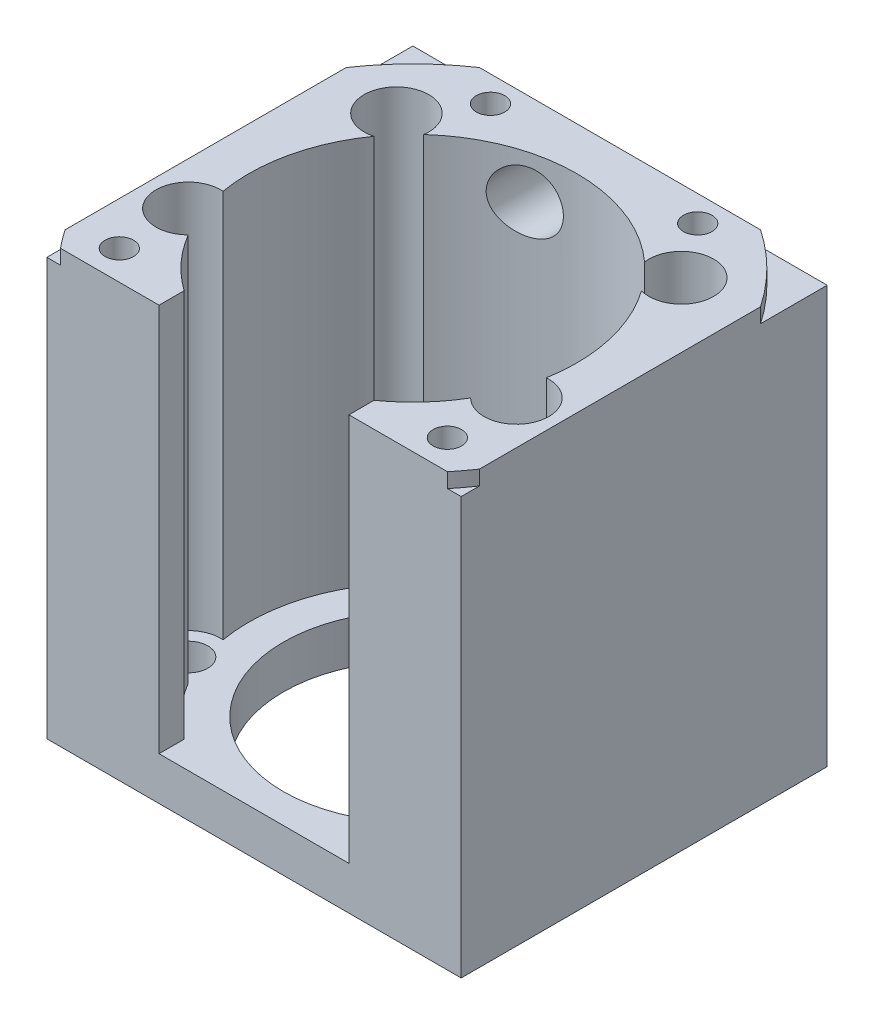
ISO-10303-21;
HEADER;
FILE_DESCRIPTION(('STEP AP214'),'2;1');
FILE_NAME('part.step','',(''),(''),'','','');
FILE_SCHEMA(('AUTOMOTIVE_DESIGN { 1 0 10303 214 1 1 1 1 }'));
ENDSEC;
DATA;
#1=APPLICATION_CONTEXT('core data for automotive mechanical design processes');
#2=APPLICATION_PROTOCOL_DEFINITION('international standard','automotive_design',2000,#1);
#3=PRODUCT_CONTEXT('',#1,'mechanical');
#4=PRODUCT('Part','Part','',(#3));
#5=PRODUCT_RELATED_PRODUCT_CATEGORY('part','',(#4));
#6=PRODUCT_DEFINITION_FORMATION('','',#4);
#7=PRODUCT_DEFINITION_CONTEXT('part definition',#1,'design');
#8=PRODUCT_DEFINITION('design','',#6,#7);
#9=PRODUCT_DEFINITION_SHAPE('','',#8);
#10=(LENGTH_UNIT() NAMED_UNIT(*) SI_UNIT(.MILLI.,.METRE.));
#11=(NAMED_UNIT(*) PLANE_ANGLE_UNIT() SI_UNIT($,.RADIAN.));
#12=(NAMED_UNIT(*) SI_UNIT($,.STERADIAN.) SOLID_ANGLE_UNIT());
#13=UNCERTAINTY_MEASURE_WITH_UNIT(LENGTH_MEASURE(1.E-05),#10,'distance_accuracy_value','');
#14=(GEOMETRIC_REPRESENTATION_CONTEXT(3) GLOBAL_UNCERTAINTY_ASSIGNED_CONTEXT((#13)) GLOBAL_UNIT_ASSIGNED_CONTEXT((#10,
#11,#12)) REPRESENTATION_CONTEXT('',''));
#15=CARTESIAN_POINT('',(0.,0.,0.));
#16=DIRECTION('',(0.,0.,1.));
#17=DIRECTION('',(1.,0.,0.));
#18=AXIS2_PLACEMENT_3D('',#15,#16,#17);
#19=CARTESIAN_POINT('',(0.,50.,0.));
#20=DIRECTION('',(1.,0.,0.));
#21=DIRECTION('',(0.,0.,-1.));
#22=AXIS2_PLACEMENT_3D('',#19,#20,#21);
#23=PLANE('',#22);
#24=DIRECTION('',(0.,0.,1.));
#25=VECTOR('',#24,1.);
#26=CARTESIAN_POINT('',(0.,48.3,0.));
#27=LINE('',#26,#25);
#28=CARTESIAN_POINT('',(0.,48.3,-42.4));
#29=VERTEX_POINT('',#28);
#30=CARTESIAN_POINT('',(0.,48.3,-34.6788205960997));
#31=VERTEX_POINT('',#30);
#32=EDGE_CURVE('E482',#29,#31,#27,.T.);
#33=ORIENTED_EDGE('',*,*,#32,.F.);
#34=DIRECTION('',(0.,-1.,0.));
#35=VECTOR('',#34,1.);
#36=CARTESIAN_POINT('',(0.,50.,-42.4));
#37=LINE('',#36,#35);
#38=CARTESIAN_POINT('',(0.,0.,-42.4));
#39=VERTEX_POINT('',#38);
#40=EDGE_CURVE('E319',#29,#39,#37,.T.);
#41=ORIENTED_EDGE('',*,*,#40,.T.);
#42=DIRECTION('',(0.,0.,1.));
#43=VECTOR('',#42,1.);
#44=CARTESIAN_POINT('',(0.,0.,0.));
#45=LINE('',#44,#43);
#46=CARTESIAN_POINT('',(0.,0.,0.));
#47=VERTEX_POINT('',#46);
#48=EDGE_CURVE('E305',#39,#47,#45,.T.);
#49=ORIENTED_EDGE('',*,*,#48,.T.);
#50=DIRECTION('',(0.,-1.,0.));
#51=VECTOR('',#50,1.);
#52=CARTESIAN_POINT('',(0.,50.,0.));
#53=LINE('',#52,#51);
#54=CARTESIAN_POINT('',(0.,48.3,0.));
#55=VERTEX_POINT('',#54);
#56=EDGE_CURVE('E335',#55,#47,#53,.T.);
#57=ORIENTED_EDGE('',*,*,#56,.F.);
#58=CARTESIAN_POINT('',(0.,48.3,-2.12117940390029));
#59=VERTEX_POINT('',#58);
#60=EDGE_CURVE('E491',#59,#55,#27,.T.);
#61=ORIENTED_EDGE('',*,*,#60,.F.);
#62=DIRECTION('',(0.,1.,0.));
#63=VECTOR('',#62,1.);
#64=CARTESIAN_POINT('',(0.,48.3,-2.12117940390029));
#65=LINE('',#64,#63);
#66=CARTESIAN_POINT('',(0.,50.,-2.12117940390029));
#67=VERTEX_POINT('',#66);
#68=EDGE_CURVE('E914',#67,#59,#65,.F.);
#69=ORIENTED_EDGE('',*,*,#68,.F.);
#70=DIRECTION('',(0.,0.,1.));
#71=VECTOR('',#70,1.);
#72=CARTESIAN_POINT('',(0.,50.,0.));
#73=LINE('',#72,#71);
#74=CARTESIAN_POINT('',(0.,50.,-34.6788205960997));
#75=VERTEX_POINT('',#74);
#76=EDGE_CURVE('E306',#75,#67,#73,.T.);
#77=ORIENTED_EDGE('',*,*,#76,.F.);
#78=DIRECTION('',(0.,1.,0.));
#79=VECTOR('',#78,1.);
#80=CARTESIAN_POINT('',(0.,48.3,-34.6788205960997));
#81=LINE('',#80,#79);
#82=EDGE_CURVE('E485',#31,#75,#81,.T.);
#83=ORIENTED_EDGE('',*,*,#82,.F.);
#84=EDGE_LOOP('',(#33,#41,#49,#57,#61,#69,#77,#83));
#85=FACE_BOUND('',#84,.T.);
#86=ADVANCED_FACE('F41',(#85),#23,.F.);
#87=CARTESIAN_POINT('',(0.,50.,0.));
#88=DIRECTION('',(0.,0.,-1.));
#89=DIRECTION('',(-1.,0.,0.));
#90=AXIS2_PLACEMENT_3D('',#87,#88,#89);
#91=PLANE('',#90);
#92=DIRECTION('',(1.,0.,0.));
#93=VECTOR('',#92,1.);
#94=CARTESIAN_POINT('',(0.,48.3,0.));
#95=LINE('',#94,#93);
#96=CARTESIAN_POINT('',(1.58482656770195,48.3,0.));
#97=VERTEX_POINT('',#96);
#98=EDGE_CURVE('E508',#55,#97,#95,.T.);
#99=ORIENTED_EDGE('',*,*,#98,.F.);
#100=ORIENTED_EDGE('',*,*,#56,.T.);
#101=DIRECTION('',(1.,0.,0.));
#102=VECTOR('',#101,1.);
#103=CARTESIAN_POINT('',(0.,0.,0.));
#104=LINE('',#103,#102);
#105=CARTESIAN_POINT('',(48.,0.,0.));
#106=VERTEX_POINT('',#105);
#107=EDGE_CURVE('E322',#47,#106,#104,.T.);
#108=ORIENTED_EDGE('',*,*,#107,.T.);
#109=DIRECTION('',(0.,-1.,0.));
#110=VECTOR('',#109,1.);
#111=CARTESIAN_POINT('',(48.,50.,0.));
#112=LINE('',#111,#110);
#113=CARTESIAN_POINT('',(48.,48.3,0.));
#114=VERTEX_POINT('',#113);
#115=EDGE_CURVE('E333',#114,#106,#112,.T.);
#116=ORIENTED_EDGE('',*,*,#115,.F.);
#117=CARTESIAN_POINT('',(46.415173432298,48.3,0.));
#118=VERTEX_POINT('',#117);
#119=EDGE_CURVE('E511',#118,#114,#95,.T.);
#120=ORIENTED_EDGE('',*,*,#119,.F.);
#121=DIRECTION('',(0.,1.,0.));
#122=VECTOR('',#121,1.);
#123=CARTESIAN_POINT('',(46.415173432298,48.3,0.));
#124=LINE('',#123,#122);
#125=CARTESIAN_POINT('',(46.415173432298,50.,0.));
#126=VERTEX_POINT('',#125);
#127=EDGE_CURVE('E911',#126,#118,#124,.F.);
#128=ORIENTED_EDGE('',*,*,#127,.F.);
#129=DIRECTION('',(1.,0.,0.));
#130=VECTOR('',#129,1.);
#131=CARTESIAN_POINT('',(0.,50.,0.));
#132=LINE('',#131,#130);
#133=CARTESIAN_POINT('',(35.,50.,0.));
#134=VERTEX_POINT('',#133);
#135=EDGE_CURVE('E309',#134,#126,#132,.T.);
#136=ORIENTED_EDGE('',*,*,#135,.F.);
#137=DIRECTION('',(0.,1.,0.));
#138=VECTOR('',#137,1.);
#139=CARTESIAN_POINT('',(35.,5.,0.));
#140=LINE('',#139,#138);
#141=CARTESIAN_POINT('',(35.,5.,0.));
#142=VERTEX_POINT('',#141);
#143=EDGE_CURVE('E277',#142,#134,#140,.T.);
#144=ORIENTED_EDGE('',*,*,#143,.F.);
#145=DIRECTION('',(1.,0.,0.));
#146=VECTOR('',#145,1.);
#147=CARTESIAN_POINT('',(0.,5.,0.));
#148=LINE('',#147,#146);
#149=CARTESIAN_POINT('',(13.,5.,0.));
#150=VERTEX_POINT('',#149);
#151=EDGE_CURVE('E300',#150,#142,#148,.T.);
#152=ORIENTED_EDGE('',*,*,#151,.F.);
#153=DIRECTION('',(0.,1.,0.));
#154=VECTOR('',#153,1.);
#155=CARTESIAN_POINT('',(13.,5.,0.));
#156=LINE('',#155,#154);
#157=CARTESIAN_POINT('',(13.,50.,0.));
#158=VERTEX_POINT('',#157);
#159=EDGE_CURVE('E272',#150,#158,#156,.T.);
#160=ORIENTED_EDGE('',*,*,#159,.T.);
#161=CARTESIAN_POINT('',(1.58482656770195,50.,0.));
#162=VERTEX_POINT('',#161);
#163=EDGE_CURVE('E311',#162,#158,#132,.T.);
#164=ORIENTED_EDGE('',*,*,#163,.F.);
#165=DIRECTION('',(0.,1.,0.));
#166=VECTOR('',#165,1.);
#167=CARTESIAN_POINT('',(1.58482656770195,48.3,0.));
#168=LINE('',#167,#166);
#169=EDGE_CURVE('E66',#97,#162,#168,.T.);
#170=ORIENTED_EDGE('',*,*,#169,.F.);
#171=EDGE_LOOP('',(#99,#100,#108,#116,#120,#128,#136,#144,#152,#160,#164,#170));
#172=FACE_BOUND('',#171,.T.);
#173=ADVANCED_FACE('F473',(#172),#91,.F.);
#174=CARTESIAN_POINT('',(48.,50.,0.));
#175=DIRECTION('',(-1.,0.,0.));
#176=DIRECTION('',(0.,0.,1.));
#177=AXIS2_PLACEMENT_3D('',#174,#175,#176);
#178=PLANE('',#177);
#179=DIRECTION('',(0.,0.,-1.));
#180=VECTOR('',#179,1.);
#181=CARTESIAN_POINT('',(48.,48.3,0.));
#182=LINE('',#181,#180);
#183=CARTESIAN_POINT('',(48.,48.3,-2.12117940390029));
#184=VERTEX_POINT('',#183);
#185=EDGE_CURVE('E514',#114,#184,#182,.T.);
#186=ORIENTED_EDGE('',*,*,#185,.F.);
#187=ORIENTED_EDGE('',*,*,#115,.T.);
#188=DIRECTION('',(0.,0.,-1.));
#189=VECTOR('',#188,1.);
#190=CARTESIAN_POINT('',(48.,0.,0.));
#191=LINE('',#190,#189);
#192=CARTESIAN_POINT('',(48.,0.,-42.4));
#193=VERTEX_POINT('',#192);
#194=EDGE_CURVE('E325',#106,#193,#191,.T.);
#195=ORIENTED_EDGE('',*,*,#194,.T.);
#196=DIRECTION('',(0.,-1.,0.));
#197=VECTOR('',#196,1.);
#198=CARTESIAN_POINT('',(48.,50.,-42.4));
#199=LINE('',#198,#197);
#200=CARTESIAN_POINT('',(48.,48.3,-42.4));
#201=VERTEX_POINT('',#200);
#202=EDGE_CURVE('E331',#201,#193,#199,.T.);
#203=ORIENTED_EDGE('',*,*,#202,.F.);
#204=CARTESIAN_POINT('',(48.,48.3,-34.6788205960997));
#205=VERTEX_POINT('',#204);
#206=EDGE_CURVE('E489',#205,#201,#182,.T.);
#207=ORIENTED_EDGE('',*,*,#206,.F.);
#208=DIRECTION('',(0.,1.,0.));
#209=VECTOR('',#208,1.);
#210=CARTESIAN_POINT('',(48.,48.3,-34.6788205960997));
#211=LINE('',#210,#209);
#212=CARTESIAN_POINT('',(48.,50.,-34.6788205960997));
#213=VERTEX_POINT('',#212);
#214=EDGE_CURVE('E907',#213,#205,#211,.F.);
#215=ORIENTED_EDGE('',*,*,#214,.F.);
#216=DIRECTION('',(0.,0.,-1.));
#217=VECTOR('',#216,1.);
#218=CARTESIAN_POINT('',(48.,50.,0.));
#219=LINE('',#218,#217);
#220=CARTESIAN_POINT('',(48.,50.,-2.12117940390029));
#221=VERTEX_POINT('',#220);
#222=EDGE_CURVE('E313',#221,#213,#219,.T.);
#223=ORIENTED_EDGE('',*,*,#222,.F.);
#224=DIRECTION('',(0.,1.,0.));
#225=VECTOR('',#224,1.);
#226=CARTESIAN_POINT('',(48.,48.3,-2.12117940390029));
#227=LINE('',#226,#225);
#228=EDGE_CURVE('E909',#184,#221,#227,.T.);
#229=ORIENTED_EDGE('',*,*,#228,.F.);
#230=EDGE_LOOP('',(#186,#187,#195,#203,#207,#215,#223,#229));
#231=FACE_BOUND('',#230,.T.);
#232=ADVANCED_FACE('F478',(#231),#178,.F.);
#233=CARTESIAN_POINT('',(0.,50.,-42.4));
#234=DIRECTION('',(0.,0.,1.));
#235=DIRECTION('',(1.,0.,0.));
#236=AXIS2_PLACEMENT_3D('',#233,#234,#235);
#237=PLANE('',#236);
#238=CARTESIAN_POINT('',(34.,10.,-42.4));
#239=DIRECTION('',(0.,0.,-1.));
#240=DIRECTION('',(-1.,0.,0.));
#241=AXIS2_PLACEMENT_3D('',#238,#239,#240);
#242=CIRCLE('',#241,3.5);
#243=CARTESIAN_POINT('',(30.5,10.,-42.4));
#244=VERTEX_POINT('',#243);
#245=EDGE_CURVE('E232',#244,#244,#242,.T.);
#246=ORIENTED_EDGE('',*,*,#245,.F.);
#247=EDGE_LOOP('',(#246));
#248=FACE_BOUND('',#247,.T.);
#249=CARTESIAN_POINT('',(19.,45.,-42.4));
#250=DIRECTION('',(0.,0.,-1.));
#251=DIRECTION('',(-1.,0.,0.));
#252=AXIS2_PLACEMENT_3D('',#249,#250,#251);
#253=CIRCLE('',#252,3.5);
#254=CARTESIAN_POINT('',(15.5,45.,-42.4));
#255=VERTEX_POINT('',#254);
#256=EDGE_CURVE('E231',#255,#255,#253,.T.);
#257=ORIENTED_EDGE('',*,*,#256,.F.);
#258=EDGE_LOOP('',(#257));
#259=FACE_BOUND('',#258,.T.);
#260=DIRECTION('',(-1.,0.,0.));
#261=VECTOR('',#260,1.);
#262=CARTESIAN_POINT('',(0.,48.3,-42.4));
#263=LINE('',#262,#261);
#264=CARTESIAN_POINT('',(40.2788205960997,48.3,-42.4));
#265=VERTEX_POINT('',#264);
#266=EDGE_CURVE('E53',#201,#265,#263,.T.);
#267=ORIENTED_EDGE('',*,*,#266,.F.);
#268=ORIENTED_EDGE('',*,*,#202,.T.);
#269=DIRECTION('',(-1.,0.,0.));
#270=VECTOR('',#269,1.);
#271=CARTESIAN_POINT('',(0.,0.,-42.4));
#272=LINE('',#271,#270);
#273=EDGE_CURVE('E310',#193,#39,#272,.T.);
#274=ORIENTED_EDGE('',*,*,#273,.T.);
#275=ORIENTED_EDGE('',*,*,#40,.F.);
#276=CARTESIAN_POINT('',(7.72117940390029,48.3,-42.4));
#277=VERTEX_POINT('',#276);
#278=EDGE_CURVE('E358',#277,#29,#263,.T.);
#279=ORIENTED_EDGE('',*,*,#278,.F.);
#280=DIRECTION('',(0.,1.,0.));
#281=VECTOR('',#280,1.);
#282=CARTESIAN_POINT('',(7.72117940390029,48.3,-42.4));
#283=LINE('',#282,#281);
#284=CARTESIAN_POINT('',(7.72117940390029,50.,-42.4));
#285=VERTEX_POINT('',#284);
#286=EDGE_CURVE('E899',#285,#277,#283,.F.);
#287=ORIENTED_EDGE('',*,*,#286,.F.);
#288=DIRECTION('',(-1.,0.,0.));
#289=VECTOR('',#288,1.);
#290=CARTESIAN_POINT('',(0.,50.,-42.4));
#291=LINE('',#290,#289);
#292=CARTESIAN_POINT('',(40.2788205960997,50.,-42.4));
#293=VERTEX_POINT('',#292);
#294=EDGE_CURVE('E316',#293,#285,#291,.T.);
#295=ORIENTED_EDGE('',*,*,#294,.F.);
#296=DIRECTION('',(0.,1.,0.));
#297=VECTOR('',#296,1.);
#298=CARTESIAN_POINT('',(40.2788205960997,48.3,-42.4));
#299=LINE('',#298,#297);
#300=EDGE_CURVE('E905',#265,#293,#299,.T.);
#301=ORIENTED_EDGE('',*,*,#300,.F.);
#302=EDGE_LOOP('',(#267,#268,#274,#275,#279,#287,#295,#301));
#303=FACE_BOUND('',#302,.T.);
#304=ADVANCED_FACE('F495',(#248,#259,#303),#237,.F.);
#305=CARTESIAN_POINT('',(0.,50.,0.));
#306=DIRECTION('',(0.,-1.,0.));
#307=DIRECTION('',(0.,0.,-1.));
#308=AXIS2_PLACEMENT_3D('',#305,#306,#307);
#309=PLANE('',#308);
#310=CARTESIAN_POINT('',(12.,50.,-39.4));
#311=DIRECTION('',(0.,1.,0.));
#312=DIRECTION('',(0.,0.,1.));
#313=AXIS2_PLACEMENT_3D('',#310,#311,#312);
#314=CIRCLE('',#313,1.65);
#315=CARTESIAN_POINT('',(12.,50.,-37.75));
#316=VERTEX_POINT('',#315);
#317=EDGE_CURVE('E513',#316,#316,#314,.T.);
#318=ORIENTED_EDGE('',*,*,#317,.F.);
#319=EDGE_LOOP('',(#318));
#320=FACE_BOUND('',#319,.T.);
#321=CARTESIAN_POINT('',(36.,50.,-39.4));
#322=DIRECTION('',(0.,1.,0.));
#323=DIRECTION('',(0.,0.,1.));
#324=AXIS2_PLACEMENT_3D('',#321,#322,#323);
#325=CIRCLE('',#324,1.65);
#326=CARTESIAN_POINT('',(36.,50.,-37.75));
#327=VERTEX_POINT('',#326);
#328=EDGE_CURVE('E522',#327,#327,#325,.T.);
#329=ORIENTED_EDGE('',*,*,#328,.F.);
#330=EDGE_LOOP('',(#329));
#331=FACE_BOUND('',#330,.T.);
#332=CARTESIAN_POINT('',(5.,50.,-3.4));
#333=DIRECTION('',(0.,1.,0.));
#334=DIRECTION('',(0.,0.,1.));
#335=AXIS2_PLACEMENT_3D('',#332,#333,#334);
#336=CIRCLE('',#335,1.65);
#337=CARTESIAN_POINT('',(5.,50.,-1.75));
#338=VERTEX_POINT('',#337);
#339=EDGE_CURVE('E528',#338,#338,#336,.T.);
#340=ORIENTED_EDGE('',*,*,#339,.F.);
#341=EDGE_LOOP('',(#340));
#342=FACE_BOUND('',#341,.T.);
#343=CARTESIAN_POINT('',(43.,50.,-3.4));
#344=DIRECTION('',(0.,1.,0.));
#345=DIRECTION('',(0.,0.,1.));
#346=AXIS2_PLACEMENT_3D('',#343,#344,#345);
#347=CIRCLE('',#346,1.65);
#348=CARTESIAN_POINT('',(43.,50.,-1.75000000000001));
#349=VERTEX_POINT('',#348);
#350=EDGE_CURVE('E534',#349,#349,#347,.T.);
#351=ORIENTED_EDGE('',*,*,#350,.F.);
#352=EDGE_LOOP('',(#351));
#353=FACE_BOUND('',#352,.T.);
#354=CARTESIAN_POINT('',(24.,50.,-18.4));
#355=DIRECTION('',(0.,-1.,0.));
#356=DIRECTION('',(0.,0.,-1.));
#357=AXIS2_PLACEMENT_3D('',#354,#355,#356);
#358=CIRCLE('',#357,29.);
#359=EDGE_CURVE('E357',#293,#213,#358,.T.);
#360=ORIENTED_EDGE('',*,*,#359,.F.);
#361=ORIENTED_EDGE('',*,*,#294,.T.);
#362=EDGE_CURVE('E347',#75,#285,#358,.T.);
#363=ORIENTED_EDGE('',*,*,#362,.F.);
#364=ORIENTED_EDGE('',*,*,#76,.T.);
#365=EDGE_CURVE('E356',#162,#67,#358,.T.);
#366=ORIENTED_EDGE('',*,*,#365,.F.);
#367=ORIENTED_EDGE('',*,*,#163,.T.);
#368=DIRECTION('',(0.,0.,1.));
#369=VECTOR('',#368,1.);
#370=CARTESIAN_POINT('',(13.,50.,0.));
#371=LINE('',#370,#369);
#372=CARTESIAN_POINT('',(13.,50.,-2.90806661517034));
#373=VERTEX_POINT('',#372);
#374=EDGE_CURVE('E273',#373,#158,#371,.T.);
#375=ORIENTED_EDGE('',*,*,#374,.F.);
#376=CARTESIAN_POINT('',(24.,50.,-18.4));
#377=DIRECTION('',(0.,1.,0.));
#378=DIRECTION('',(0.,0.,1.));
#379=AXIS2_PLACEMENT_3D('',#376,#377,#378);
#380=CIRCLE('',#379,19.);
#381=CARTESIAN_POINT('',(7.64053967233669,50.,-8.73728517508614));
#382=VERTEX_POINT('',#381);
#383=EDGE_CURVE('E287',#382,#373,#380,.T.);
#384=ORIENTED_EDGE('',*,*,#383,.F.);
#385=CARTESIAN_POINT('',(5.,50.,-11.4));
#386=DIRECTION('',(0.,1.,0.));
#387=DIRECTION('',(0.,0.,1.));
#388=AXIS2_PLACEMENT_3D('',#385,#386,#387);
#389=CIRCLE('',#388,3.75);
#390=CARTESIAN_POINT('',(5.28186886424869,50.,-15.1393916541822));
#391=VERTEX_POINT('',#390);
#392=EDGE_CURVE('E550',#391,#382,#389,.T.);
#393=ORIENTED_EDGE('',*,*,#392,.F.);
#394=CARTESIAN_POINT('',(8.49749813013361,50.,-29.3851006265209));
#395=VERTEX_POINT('',#394);
#396=EDGE_CURVE('E299',#395,#391,#380,.T.);
#397=ORIENTED_EDGE('',*,*,#396,.F.);
#398=CARTESIAN_POINT('',(7.5,50.,-33.));
#399=DIRECTION('',(0.,1.,0.));
#400=DIRECTION('',(0.,0.,1.));
#401=AXIS2_PLACEMENT_3D('',#398,#399,#400);
#402=CIRCLE('',#401,3.75);
#403=CARTESIAN_POINT('',(11.2094429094,50.,-32.4499697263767));
#404=VERTEX_POINT('',#403);
#405=EDGE_CURVE('E241',#404,#395,#402,.T.);
#406=ORIENTED_EDGE('',*,*,#405,.F.);
#407=CARTESIAN_POINT('',(36.7905570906,50.,-32.4499697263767));
#408=VERTEX_POINT('',#407);
#409=EDGE_CURVE('E577',#408,#404,#380,.T.);
#410=ORIENTED_EDGE('',*,*,#409,.F.);
#411=CARTESIAN_POINT('',(40.5,50.,-33.));
#412=DIRECTION('',(0.,1.,0.));
#413=DIRECTION('',(0.,0.,1.));
#414=AXIS2_PLACEMENT_3D('',#411,#412,#413);
#415=CIRCLE('',#414,3.75000000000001);
#416=CARTESIAN_POINT('',(39.5025018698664,50.,-29.3851006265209));
#417=VERTEX_POINT('',#416);
#418=EDGE_CURVE('E237',#417,#408,#415,.T.);
#419=ORIENTED_EDGE('',*,*,#418,.F.);
#420=CARTESIAN_POINT('',(42.7181311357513,50.,-15.1393916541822));
#421=VERTEX_POINT('',#420);
#422=EDGE_CURVE('E298',#421,#417,#380,.T.);
#423=ORIENTED_EDGE('',*,*,#422,.F.);
#424=CARTESIAN_POINT('',(43.,50.,-11.4));
#425=DIRECTION('',(0.,1.,0.));
#426=DIRECTION('',(0.,0.,1.));
#427=AXIS2_PLACEMENT_3D('',#424,#425,#426);
#428=CIRCLE('',#427,3.75);
#429=CARTESIAN_POINT('',(40.3594603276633,50.,-8.73728517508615));
#430=VERTEX_POINT('',#429);
#431=EDGE_CURVE('E540',#430,#421,#428,.T.);
#432=ORIENTED_EDGE('',*,*,#431,.F.);
#433=CARTESIAN_POINT('',(35.,50.,-2.90806661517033));
#434=VERTEX_POINT('',#433);
#435=EDGE_CURVE('E294',#434,#430,#380,.T.);
#436=ORIENTED_EDGE('',*,*,#435,.F.);
#437=DIRECTION('',(0.,0.,-1.));
#438=VECTOR('',#437,1.);
#439=CARTESIAN_POINT('',(35.,50.,0.));
#440=LINE('',#439,#438);
#441=EDGE_CURVE('E270',#134,#434,#440,.T.);
#442=ORIENTED_EDGE('',*,*,#441,.F.);
#443=ORIENTED_EDGE('',*,*,#135,.T.);
#444=CARTESIAN_POINT('',(24.,50.,-18.4));
#445=DIRECTION('',(0.,1.,0.));
#446=DIRECTION('',(0.,0.,1.));
#447=AXIS2_PLACEMENT_3D('',#444,#445,#446);
#448=CIRCLE('',#447,29.);
#449=EDGE_CURVE('E365',#126,#221,#448,.T.);
#450=ORIENTED_EDGE('',*,*,#449,.T.);
#451=ORIENTED_EDGE('',*,*,#222,.T.);
#452=EDGE_LOOP('',(#360,#361,#363,#364,#366,#367,#375,#384,#393,#397,#406,#410,#419,#423,#432,
#436,#442,#443,#450,#451));
#453=FACE_BOUND('',#452,.T.);
#454=ADVANCED_FACE('F445',(#320,#331,#342,#353,#453),#309,.F.);
#455=CARTESIAN_POINT('',(43.,-5.,-11.4));
#456=DIRECTION('',(0.,1.,0.));
#457=DIRECTION('',(0.,0.,1.));
#458=AXIS2_PLACEMENT_3D('',#455,#456,#457);
#459=CYLINDRICAL_SURFACE('',#458,2.25);
#460=CARTESIAN_POINT('',(43.,0.,-11.4));
#461=DIRECTION('',(0.,-1.,0.));
#462=DIRECTION('',(0.,0.,-1.));
#463=AXIS2_PLACEMENT_3D('',#460,#461,#462);
#464=CIRCLE('',#463,2.25);
#465=CARTESIAN_POINT('',(43.,0.,-13.65));
#466=VERTEX_POINT('',#465);
#467=EDGE_CURVE('E259',#466,#466,#464,.T.);
#468=ORIENTED_EDGE('',*,*,#467,.T.);
#469=EDGE_LOOP('',(#468));
#470=FACE_BOUND('',#469,.T.);
#471=CARTESIAN_POINT('',(43.,5.,-11.4));
#472=DIRECTION('',(0.,1.,0.));
#473=DIRECTION('',(0.,0.,1.));
#474=AXIS2_PLACEMENT_3D('',#471,#472,#473);
#475=CIRCLE('',#474,2.25);
#476=CARTESIAN_POINT('',(43.,5.,-9.15000000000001));
#477=VERTEX_POINT('',#476);
#478=EDGE_CURVE('E344',#477,#477,#475,.T.);
#479=ORIENTED_EDGE('',*,*,#478,.T.);
#480=EDGE_LOOP('',(#479));
#481=FACE_BOUND('',#480,.T.);
#482=ADVANCED_FACE('F441',(#470,#481),#459,.F.);
#483=CARTESIAN_POINT('',(5.,-5.,-11.4));
#484=DIRECTION('',(0.,1.,0.));
#485=DIRECTION('',(0.,0.,1.));
#486=AXIS2_PLACEMENT_3D('',#483,#484,#485);
#487=CYLINDRICAL_SURFACE('',#486,2.25);
#488=CARTESIAN_POINT('',(5.,0.,-11.4));
#489=DIRECTION('',(0.,-1.,0.));
#490=DIRECTION('',(0.,0.,-1.));
#491=AXIS2_PLACEMENT_3D('',#488,#489,#490);
#492=CIRCLE('',#491,2.25);
#493=CARTESIAN_POINT('',(5.,0.,-13.65));
#494=VERTEX_POINT('',#493);
#495=EDGE_CURVE('E262',#494,#494,#492,.T.);
#496=ORIENTED_EDGE('',*,*,#495,.T.);
#497=EDGE_LOOP('',(#496));
#498=FACE_BOUND('',#497,.T.);
#499=CARTESIAN_POINT('',(5.,5.,-11.4));
#500=DIRECTION('',(0.,1.,0.));
#501=DIRECTION('',(0.,0.,1.));
#502=AXIS2_PLACEMENT_3D('',#499,#500,#501);
#503=CIRCLE('',#502,2.25);
#504=CARTESIAN_POINT('',(5.,5.,-9.15));
#505=VERTEX_POINT('',#504);
#506=EDGE_CURVE('E337',#505,#505,#503,.T.);
#507=ORIENTED_EDGE('',*,*,#506,.T.);
#508=EDGE_LOOP('',(#507));
#509=FACE_BOUND('',#508,.T.);
#510=ADVANCED_FACE('F444',(#498,#509),#487,.F.);
#511=CARTESIAN_POINT('',(24.,5.,-18.4));
#512=DIRECTION('',(0.,1.,0.));
#513=DIRECTION('',(0.,0.,1.));
#514=AXIS2_PLACEMENT_3D('',#511,#512,#513);
#515=CYLINDRICAL_SURFACE('',#514,19.);
#516=CARTESIAN_POINT('',(15.5,45.,-35.3926454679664));
#517=CARTESIAN_POINT('',(15.5000118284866,45.1831965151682,-35.3926540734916));
#518=CARTESIAN_POINT('',(15.5144573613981,45.3665040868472,-35.3999010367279));
#519=CARTESIAN_POINT('',(15.5715816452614,45.7276364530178,-35.4282920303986));
#520=CARTESIAN_POINT('',(15.614287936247,45.9054557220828,-35.4494496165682));
#521=CARTESIAN_POINT('',(15.7258431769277,46.2500365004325,-35.5038630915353));
#522=CARTESIAN_POINT('',(15.794608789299,46.416831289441,-35.5370803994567));
#523=CARTESIAN_POINT('',(15.9556853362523,46.7361318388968,-35.6132770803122));
#524=CARTESIAN_POINT('',(16.047998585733,46.8886361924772,-35.656257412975));
#525=CARTESIAN_POINT('',(16.2588718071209,47.1842455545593,-35.7519167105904));
#526=CARTESIAN_POINT('',(16.3785770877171,47.3264027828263,-35.8049931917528));
#527=CARTESIAN_POINT('',(16.6377031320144,47.5891375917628,-35.9161772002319));
#528=CARTESIAN_POINT('',(16.7771313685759,47.7097069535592,-35.97428663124));
#529=CARTESIAN_POINT('',(17.0860030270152,47.9371169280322,-36.0982130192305));
#530=CARTESIAN_POINT('',(17.257024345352,48.0417011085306,-36.1642494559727));
#531=CARTESIAN_POINT('',(17.6145412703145,48.2203191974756,-36.295871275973));
#532=CARTESIAN_POINT('',(17.8010412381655,48.2943444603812,-36.3614565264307));
#533=CARTESIAN_POINT('',(18.1916865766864,48.4116905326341,-36.4916357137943));
#534=CARTESIAN_POINT('',(18.3962199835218,48.4538544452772,-36.5561159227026));
#535=CARTESIAN_POINT('',(18.8113074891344,48.501142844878,-36.6790667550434));
#536=CARTESIAN_POINT('',(19.0218604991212,48.506273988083,-36.7375384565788));
#537=CARTESIAN_POINT('',(19.4362670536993,48.4787212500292,-36.844967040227));
#538=CARTESIAN_POINT('',(19.6401341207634,48.4471541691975,-36.8941546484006));
#539=CARTESIAN_POINT('',(20.0408616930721,48.348009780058,-36.9840622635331));
#540=CARTESIAN_POINT('',(20.2377242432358,48.2804430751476,-37.0247847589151));
#541=CARTESIAN_POINT('',(20.608591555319,48.1147569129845,-37.0957843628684));
#542=CARTESIAN_POINT('',(20.7832383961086,48.0182456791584,-37.1264665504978));
#543=CARTESIAN_POINT('',(21.1143514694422,47.79628725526,-37.1803407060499));
#544=CARTESIAN_POINT('',(21.2708203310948,47.6708442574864,-37.2035337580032));
#545=CARTESIAN_POINT('',(21.556745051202,47.3981436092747,-37.2427931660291));
#546=CARTESIAN_POINT('',(21.6867900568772,47.2515268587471,-37.2590268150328));
#547=CARTESIAN_POINT('',(21.9207905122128,46.9383466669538,-37.2862596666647));
#548=CARTESIAN_POINT('',(22.0247466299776,46.7717837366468,-37.2972590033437));
#549=CARTESIAN_POINT('',(22.2031611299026,46.4240205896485,-37.3150580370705));
#550=CARTESIAN_POINT('',(22.2777124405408,46.2428687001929,-37.3218710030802));
#551=CARTESIAN_POINT('',(22.3956138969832,45.8705918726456,-37.3322336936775));
#552=CARTESIAN_POINT('',(22.4389635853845,45.6794667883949,-37.3357833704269));
#553=CARTESIAN_POINT('',(22.4932929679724,45.2920369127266,-37.3401846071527));
#554=CARTESIAN_POINT('',(22.5041723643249,45.0957179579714,-37.3410278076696));
#555=CARTESIAN_POINT('',(22.4929626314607,44.7040275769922,-37.3401390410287));
#556=CARTESIAN_POINT('',(22.470873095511,44.5086561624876,-37.338407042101));
#557=CARTESIAN_POINT('',(22.3943148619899,44.1241590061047,-37.3320689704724));
#558=CARTESIAN_POINT('',(22.3398063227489,43.9350412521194,-37.3274593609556));
#559=CARTESIAN_POINT('',(22.1999688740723,43.5686934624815,-37.3146711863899));
#560=CARTESIAN_POINT('',(22.1146402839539,43.3914633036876,-37.3064926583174));
#561=CARTESIAN_POINT('',(21.9158441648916,43.0542073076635,-37.285608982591));
#562=CARTESIAN_POINT('',(21.8024188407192,42.8941561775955,-37.2729106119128));
#563=CARTESIAN_POINT('',(21.5507981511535,42.5955148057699,-37.2419062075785));
#564=CARTESIAN_POINT('',(21.4126040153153,42.4569234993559,-37.2236004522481));
#565=CARTESIAN_POINT('',(21.1161625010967,42.2054483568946,-37.1804632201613));
#566=CARTESIAN_POINT('',(20.9579783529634,42.0924864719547,-37.155652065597));
#567=CARTESIAN_POINT('',(20.6261143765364,41.894670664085,-37.0988020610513));
#568=CARTESIAN_POINT('',(20.452434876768,41.8098161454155,-37.0667633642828));
#569=CARTESIAN_POINT('',(20.0940770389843,41.6698098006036,-36.9950873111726));
#570=CARTESIAN_POINT('',(19.9093537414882,41.6147900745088,-36.9554171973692));
#571=CARTESIAN_POINT('',(19.5350235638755,41.5358468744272,-36.8689169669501));
#572=CARTESIAN_POINT('',(19.3454161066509,41.5119270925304,-36.8220860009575));
#573=CARTESIAN_POINT('',(18.9614835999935,41.4948020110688,-36.7208566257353));
#574=CARTESIAN_POINT('',(18.767166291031,41.5024250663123,-36.6662909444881));
#575=CARTESIAN_POINT('',(18.3838988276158,41.5492435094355,-36.5521193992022));
#576=CARTESIAN_POINT('',(18.1949499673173,41.5884464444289,-36.4925123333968));
#577=CARTESIAN_POINT('',(17.8183108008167,41.6994043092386,-36.3674122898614));
#578=CARTESIAN_POINT('',(17.6310907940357,41.7725930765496,-36.3017744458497));
#579=CARTESIAN_POINT('',(17.2719833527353,41.9497441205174,-36.1699304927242));
#580=CARTESIAN_POINT('',(17.1001005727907,42.0537156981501,-36.1037242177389));
#581=CARTESIAN_POINT('',(16.7706738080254,42.2938918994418,-35.9718341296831));
#582=CARTESIAN_POINT('',(16.6137779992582,42.4310348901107,-35.9062373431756));
#583=CARTESIAN_POINT('',(16.3254425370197,42.7327981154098,-35.781768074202));
#584=CARTESIAN_POINT('',(16.1940063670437,42.8974221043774,-35.722896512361));
#585=CARTESIAN_POINT('',(16.0215572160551,43.1589723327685,-35.6437905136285));
#586=CARTESIAN_POINT('',(15.9688391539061,43.2470943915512,-35.6192734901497));
#587=CARTESIAN_POINT('',(15.8710766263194,43.4282458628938,-35.573337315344));
#588=CARTESIAN_POINT('',(15.8260282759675,43.5212727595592,-35.5519165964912));
#589=CARTESIAN_POINT('',(15.7441812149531,43.7114552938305,-35.5126713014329));
#590=CARTESIAN_POINT('',(15.7073707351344,43.808604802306,-35.4948415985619));
#591=CARTESIAN_POINT('',(15.6424008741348,44.0063408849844,-35.4631720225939));
#592=CARTESIAN_POINT('',(15.6142382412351,44.1069261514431,-35.4493306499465));
#593=CARTESIAN_POINT('',(15.5606543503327,44.3378652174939,-35.422884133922));
#594=CARTESIAN_POINT('',(15.5379572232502,44.469017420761,-35.4115882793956));
#595=CARTESIAN_POINT('',(15.5076265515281,44.7334269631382,-35.3964662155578));
#596=CARTESIAN_POINT('',(15.4999913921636,44.8666840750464,-35.3926392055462));
#597=CARTESIAN_POINT('',(15.5,45.,-35.3926454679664));
#598=B_SPLINE_CURVE_WITH_KNOTS('',3,(#516,#517,#518,#519,#520,#521,#522,#523,#524,#525,#526,
#527,#528,#529,#530,#531,#532,#533,#534,#535,#536,#537,#538,#539,#540,#541,#542,#543,#544,#545,
#546,#547,#548,#549,#550,#551,#552,#553,#554,#555,#556,#557,#558,#559,#560,#561,#562,#563,#564,
#565,#566,#567,#568,#569,#570,#571,#572,#573,#574,#575,#576,#577,#578,#579,#580,#581,#582,#583,
#584,#585,#586,#587,#588,#589,#590,#591,#592,#593,#594,#595,#596,#597),.UNSPECIFIED.,.T.,.F.,(4,
2,2,2,2,2,2,2,2,2,2,2,2,2,2,2,2,2,2,2,2,2,2,2,2,2,2,2,2,2,2,2,2,2,2,2,2,2,2,2,4),(0.,
0.549089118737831,1.0987141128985,1.6465960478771,2.19453186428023,2.77196107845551,
3.34960966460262,3.97996473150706,4.61049801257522,5.26295159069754,5.91528789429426,
6.54828075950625,7.18108728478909,7.78375814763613,8.38634173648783,8.97349418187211,
9.56063158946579,10.145898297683,10.7311735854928,11.3182548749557,11.9053434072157,
12.4931549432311,13.0809603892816,13.6678881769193,14.254786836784,14.8398734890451,
15.4249477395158,16.0125918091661,16.6003056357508,17.2035502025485,17.8069389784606,
18.4384883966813,19.0702288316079,19.7225160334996,20.3748924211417,20.6912557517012,
21.0074583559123,21.3232062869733,21.6388353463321,22.038461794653,22.4380453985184),.UNSPECIFIED.);
#599=CARTESIAN_POINT('',(15.5,45.,-35.3926454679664));
#600=VERTEX_POINT('',#599);
#601=EDGE_CURVE('E359',#600,#600,#598,.T.);
#602=ORIENTED_EDGE('',*,*,#601,.T.);
#603=EDGE_LOOP('',(#602));
#604=FACE_BOUND('',#603,.T.);
#605=DIRECTION('',(0.,1.,0.));
#606=VECTOR('',#605,1.);
#607=CARTESIAN_POINT('',(36.7905570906,27.5,-32.4499697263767));
#608=LINE('',#607,#606);
#609=CARTESIAN_POINT('',(36.7905570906,5.,-32.4499697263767));
#610=VERTEX_POINT('',#609);
#611=CARTESIAN_POINT('',(36.7905570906,7.88746807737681,-32.4499697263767));
#612=VERTEX_POINT('',#611);
#613=EDGE_CURVE('E230',#610,#612,#608,.T.);
#614=ORIENTED_EDGE('',*,*,#613,.T.);
#615=CARTESIAN_POINT('',(36.8452325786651,7.96170375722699,-32.4));
#616=CARTESIAN_POINT('',(36.7680376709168,7.85402085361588,-32.4708510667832));
#617=CARTESIAN_POINT('',(36.6859226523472,7.75224053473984,-32.5449954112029));
#618=CARTESIAN_POINT('',(36.5131008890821,7.56052637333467,-32.6980918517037));
#619=CARTESIAN_POINT('',(36.4224050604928,7.47057781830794,-32.7770377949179));
#620=CARTESIAN_POINT('',(36.233811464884,7.30260211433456,-32.9378543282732));
#621=CARTESIAN_POINT('',(36.1359408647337,7.22453312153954,-33.0197133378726));
#622=CARTESIAN_POINT('',(35.9335530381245,7.07992306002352,-33.1853791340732));
#623=CARTESIAN_POINT('',(35.829033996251,7.01338515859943,-33.2691864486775));
#624=CARTESIAN_POINT('',(35.53459972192,6.8470457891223,-33.4999754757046));
#625=CARTESIAN_POINT('',(35.3386416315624,6.75898604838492,-33.647887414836));
#626=CARTESIAN_POINT('',(34.9322816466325,6.61961625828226,-33.9418182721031));
#627=CARTESIAN_POINT('',(34.7218630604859,6.56834948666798,-34.0878347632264));
#628=CARTESIAN_POINT('',(34.3876580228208,6.51945673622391,-34.3096535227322));
#629=CARTESIAN_POINT('',(34.2672120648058,6.50809523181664,-34.3876533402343));
#630=CARTESIAN_POINT('',(34.0242172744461,6.49797390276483,-34.5411171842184));
#631=CARTESIAN_POINT('',(33.9016693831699,6.49920857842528,-34.616582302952));
#632=CARTESIAN_POINT('',(33.6555082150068,6.51481201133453,-34.764344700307));
#633=CARTESIAN_POINT('',(33.5318950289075,6.5291796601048,-34.8366422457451));
#634=CARTESIAN_POINT('',(33.284908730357,6.57154163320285,-34.9774137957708));
#635=CARTESIAN_POINT('',(33.1615355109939,6.59952652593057,-35.04589041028));
#636=CARTESIAN_POINT('',(32.9286306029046,6.66603249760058,-35.1718605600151));
#637=CARTESIAN_POINT('',(32.818944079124,6.7032267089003,-35.2297687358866));
#638=CARTESIAN_POINT('',(32.6021536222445,6.78914215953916,-35.3416001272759));
#639=CARTESIAN_POINT('',(32.4950481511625,6.83785633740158,-35.3955257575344));
#640=CARTESIAN_POINT('',(32.2847516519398,6.94681497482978,-35.4990239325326));
#641=CARTESIAN_POINT('',(32.1815582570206,7.00705232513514,-35.5485991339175));
#642=CARTESIAN_POINT('',(31.9804498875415,7.13890475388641,-35.643107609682));
#643=CARTESIAN_POINT('',(31.8825339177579,7.21051767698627,-35.6880417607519));
#644=CARTESIAN_POINT('',(31.7075562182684,7.35321302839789,-35.7666739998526));
#645=CARTESIAN_POINT('',(31.6295615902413,7.42278324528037,-35.8010485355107));
#646=CARTESIAN_POINT('',(31.4793688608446,7.5694788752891,-35.8661311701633));
#647=CARTESIAN_POINT('',(31.4071698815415,7.6466031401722,-35.8968398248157));
#648=CARTESIAN_POINT('',(31.2694815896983,7.80785393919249,-35.9544925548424));
#649=CARTESIAN_POINT('',(31.2039888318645,7.8919768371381,-35.9814385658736));
#650=CARTESIAN_POINT('',(31.0805031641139,8.06661644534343,-36.0315318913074));
#651=CARTESIAN_POINT('',(31.0225096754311,8.15713266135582,-36.0546794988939));
#652=CARTESIAN_POINT('',(30.920353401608,8.33413309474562,-36.094954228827));
#653=CARTESIAN_POINT('',(30.8753804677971,8.42006570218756,-36.1124564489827));
#654=CARTESIAN_POINT('',(30.7925283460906,8.59587310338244,-36.1443943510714));
#655=CARTESIAN_POINT('',(30.7546516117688,8.68574924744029,-36.1588289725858));
#656=CARTESIAN_POINT('',(30.686444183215,8.86868831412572,-36.1846225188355));
#657=CARTESIAN_POINT('',(30.6561086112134,8.96174913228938,-36.1959834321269));
#658=CARTESIAN_POINT('',(30.6032690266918,9.15039224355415,-36.215656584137));
#659=CARTESIAN_POINT('',(30.5807678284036,9.24597542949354,-36.2239677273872));
#660=CARTESIAN_POINT('',(30.5271793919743,9.52625578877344,-36.2436946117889));
#661=CARTESIAN_POINT('',(30.5067166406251,9.71340530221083,-36.2511256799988));
#662=CARTESIAN_POINT('',(30.4960851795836,10.088560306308,-36.2549962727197));
#663=CARTESIAN_POINT('',(30.5059127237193,10.2765656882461,-36.2514371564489));
#664=CARTESIAN_POINT('',(30.5550848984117,10.6455259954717,-36.2334383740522));
#665=CARTESIAN_POINT('',(30.5940237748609,10.8265421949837,-36.2191482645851));
#666=CARTESIAN_POINT('',(30.6994576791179,11.1791020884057,-36.1797751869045));
#667=CARTESIAN_POINT('',(30.7659520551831,11.3506460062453,-36.154692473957));
#668=CARTESIAN_POINT('',(30.9245570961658,11.6809092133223,-36.0934380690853));
#669=CARTESIAN_POINT('',(31.0168555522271,11.8395230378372,-36.0571848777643));
#670=CARTESIAN_POINT('',(31.223355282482,12.1385202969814,-35.9737162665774));
#671=CARTESIAN_POINT('',(31.3375580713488,12.278902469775,-35.9265000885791));
#672=CARTESIAN_POINT('',(31.587686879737,12.5426008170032,-35.8197025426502));
#673=CARTESIAN_POINT('',(31.7241922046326,12.6652251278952,-35.7597731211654));
#674=CARTESIAN_POINT('',(32.0112500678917,12.8857700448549,-35.6291825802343));
#675=CARTESIAN_POINT('',(32.1618062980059,12.9836841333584,-35.558518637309));
#676=CARTESIAN_POINT('',(32.4828268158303,13.1597400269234,-35.4022237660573));
#677=CARTESIAN_POINT('',(32.6539482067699,13.2360612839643,-35.315898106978));
#678=CARTESIAN_POINT('',(33.0014012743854,13.3595898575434,-35.1335986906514));
#679=CARTESIAN_POINT('',(33.1777345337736,13.4067882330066,-35.0376219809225));
#680=CARTESIAN_POINT('',(33.5508879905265,13.4768156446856,-34.8265459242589));
#681=CARTESIAN_POINT('',(33.7477955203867,13.4963319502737,-34.7105081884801));
#682=CARTESIAN_POINT('',(34.1376846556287,13.5027312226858,-34.4710865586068));
#683=CARTESIAN_POINT('',(34.3306628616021,13.4895870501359,-34.3476966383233));
#684=CARTESIAN_POINT('',(34.7350461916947,13.428864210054,-34.0788250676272));
#685=CARTESIAN_POINT('',(34.945309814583,13.3767756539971,-33.9326478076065));
#686=CARTESIAN_POINT('',(35.3515597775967,13.2356664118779,-33.6382736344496));
#687=CARTESIAN_POINT('',(35.5475470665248,13.1466481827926,-33.4900768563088));
#688=CARTESIAN_POINT('',(35.8406726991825,12.9794100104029,-33.2599067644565));
#689=CARTESIAN_POINT('',(35.9439824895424,12.9130962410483,-33.1769428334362));
#690=CARTESIAN_POINT('',(36.1440559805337,12.7691516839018,-33.0129602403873));
#691=CARTESIAN_POINT('',(36.2408214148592,12.6915239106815,-32.9319410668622));
#692=CARTESIAN_POINT('',(36.427218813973,12.5247391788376,-32.7728646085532));
#693=CARTESIAN_POINT('',(36.5168321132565,12.4355535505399,-32.6948153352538));
#694=CARTESIAN_POINT('',(36.6876543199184,12.2456130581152,-32.5434311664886));
#695=CARTESIAN_POINT('',(36.768852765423,12.1448441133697,-32.4701021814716));
#696=CARTESIAN_POINT('',(36.8452325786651,12.038296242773,-32.4));
#697=B_SPLINE_CURVE_WITH_KNOTS('',3,(#615,#616,#617,#618,#619,#620,#621,#622,#623,#624,#625,
#626,#627,#628,#629,#630,#631,#632,#633,#634,#635,#636,#637,#638,#639,#640,#641,#642,#643,#644,
#645,#646,#647,#648,#649,#650,#651,#652,#653,#654,#655,#656,#657,#658,#659,#660,#661,#662,#663,
#664,#665,#666,#667,#668,#669,#670,#671,#672,#673,#674,#675,#676,#677,#678,#679,#680,#681,#682,
#683,#684,#685,#686,#687,#688,#689,#690,#691,#692,#693,#694,#695,#696),.UNSPECIFIED.,.F.,.F.,(4,
2,2,2,2,2,2,2,2,2,2,2,2,2,2,2,2,2,2,2,2,2,2,2,2,2,2,2,2,2,2,2,2,2,2,2,2,2,2,2,4),(0.,
0.450294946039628,0.900024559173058,1.34813145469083,1.79636123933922,2.57573472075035,
3.35602344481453,3.7873576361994,4.21850350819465,4.64961299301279,5.08042430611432,
5.46833085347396,5.85600023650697,6.24343121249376,6.63078886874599,6.96040461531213,
7.28997033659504,7.61936588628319,7.94873599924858,8.24403222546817,8.53943036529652,
8.83463693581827,9.12994944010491,9.69220537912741,10.2543917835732,10.8088851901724,
11.3633654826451,11.9219910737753,12.4806553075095,13.057239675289,13.6339759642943,
14.2503352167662,14.8668836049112,15.5523319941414,16.2383501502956,17.0192224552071,
17.8000428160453,18.2440441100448,18.6879273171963,19.1329334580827,19.5784863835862),.UNSPECIFIED.);
#698=CARTESIAN_POINT('',(36.7905570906,12.1125319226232,-32.4499697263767));
#699=VERTEX_POINT('',#698);
#700=EDGE_CURVE('E59',#612,#699,#697,.T.);
#701=ORIENTED_EDGE('',*,*,#700,.T.);
#702=EDGE_CURVE('E227',#699,#408,#608,.T.);
#703=ORIENTED_EDGE('',*,*,#702,.T.);
#704=ORIENTED_EDGE('',*,*,#409,.T.);
#705=DIRECTION('',(0.,1.,0.));
#706=VECTOR('',#705,1.);
#707=CARTESIAN_POINT('',(11.2094429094,27.5,-32.4499697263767));
#708=LINE('',#707,#706);
#709=CARTESIAN_POINT('',(11.2094429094,5.,-32.4499697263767));
#710=VERTEX_POINT('',#709);
#711=EDGE_CURVE('E252',#404,#710,#708,.F.);
#712=ORIENTED_EDGE('',*,*,#711,.T.);
#713=CARTESIAN_POINT('',(24.,5.,-18.4));
#714=DIRECTION('',(0.,1.,0.));
#715=DIRECTION('',(0.,0.,1.));
#716=AXIS2_PLACEMENT_3D('',#713,#714,#715);
#717=CIRCLE('',#716,19.);
#718=EDGE_CURVE('E563',#610,#710,#717,.T.);
#719=ORIENTED_EDGE('',*,*,#718,.F.);
#720=EDGE_LOOP('',(#614,#701,#703,#704,#712,#719));
#721=FACE_BOUND('',#720,.T.);
#722=ADVANCED_FACE('F226',(#604,#721),#515,.F.);
#723=CARTESIAN_POINT('',(40.5,-5.,-33.));
#724=DIRECTION('',(0.,1.,0.));
#725=DIRECTION('',(0.,0.,1.));
#726=AXIS2_PLACEMENT_3D('',#723,#724,#725);
#727=CYLINDRICAL_SURFACE('',#726,2.25);
#728=CARTESIAN_POINT('',(40.5,0.,-33.));
#729=DIRECTION('',(0.,-1.,0.));
#730=DIRECTION('',(0.,0.,-1.));
#731=AXIS2_PLACEMENT_3D('',#728,#729,#730);
#732=CIRCLE('',#731,2.25);
#733=CARTESIAN_POINT('',(40.5,0.,-35.25));
#734=VERTEX_POINT('',#733);
#735=EDGE_CURVE('E258',#734,#734,#732,.T.);
#736=ORIENTED_EDGE('',*,*,#735,.T.);
#737=EDGE_LOOP('',(#736));
#738=FACE_BOUND('',#737,.T.);
#739=CARTESIAN_POINT('',(40.5,5.,-33.));
#740=DIRECTION('',(0.,1.,0.));
#741=DIRECTION('',(0.,0.,1.));
#742=AXIS2_PLACEMENT_3D('',#739,#740,#741);
#743=CIRCLE('',#742,2.25);
#744=CARTESIAN_POINT('',(40.5,5.,-30.75));
#745=VERTEX_POINT('',#744);
#746=EDGE_CURVE('E243',#745,#745,#743,.F.);
#747=ORIENTED_EDGE('',*,*,#746,.F.);
#748=EDGE_LOOP('',(#747));
#749=FACE_BOUND('',#748,.T.);
#750=ADVANCED_FACE('F436',(#738,#749),#727,.F.);
#751=ORIENTED_EDGE('',*,*,#396,.T.);
#752=DIRECTION('',(0.,1.,0.));
#753=VECTOR('',#752,1.);
#754=CARTESIAN_POINT('',(5.28186886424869,27.5,-15.1393916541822));
#755=LINE('',#754,#753);
#756=CARTESIAN_POINT('',(5.28186886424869,5.,-15.1393916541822));
#757=VERTEX_POINT('',#756);
#758=EDGE_CURVE('E558',#391,#757,#755,.F.);
#759=ORIENTED_EDGE('',*,*,#758,.T.);
#760=CARTESIAN_POINT('',(8.49749813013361,5.,-29.3851006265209));
#761=VERTEX_POINT('',#760);
#762=EDGE_CURVE('E293',#761,#757,#717,.T.);
#763=ORIENTED_EDGE('',*,*,#762,.F.);
#764=DIRECTION('',(0.,1.,0.));
#765=VECTOR('',#764,1.);
#766=CARTESIAN_POINT('',(8.49749813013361,27.5,-29.3851006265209));
#767=LINE('',#766,#765);
#768=EDGE_CURVE('E255',#761,#395,#767,.T.);
#769=ORIENTED_EDGE('',*,*,#768,.T.);
#770=EDGE_LOOP('',(#751,#759,#763,#769));
#771=FACE_BOUND('',#770,.T.);
#772=ADVANCED_FACE('F439',(#771),#515,.F.);
#773=CARTESIAN_POINT('',(7.5,-5.,-33.));
#774=DIRECTION('',(0.,1.,0.));
#775=DIRECTION('',(0.,0.,1.));
#776=AXIS2_PLACEMENT_3D('',#773,#774,#775);
#777=CYLINDRICAL_SURFACE('',#776,2.25);
#778=CARTESIAN_POINT('',(7.5,0.,-33.));
#779=DIRECTION('',(0.,-1.,0.));
#780=DIRECTION('',(0.,0.,-1.));
#781=AXIS2_PLACEMENT_3D('',#778,#779,#780);
#782=CIRCLE('',#781,2.25);
#783=CARTESIAN_POINT('',(7.5,0.,-35.25));
#784=VERTEX_POINT('',#783);
#785=EDGE_CURVE('E265',#784,#784,#782,.T.);
#786=ORIENTED_EDGE('',*,*,#785,.T.);
#787=EDGE_LOOP('',(#786));
#788=FACE_BOUND('',#787,.T.);
#789=CARTESIAN_POINT('',(7.5,5.,-33.));
#790=DIRECTION('',(0.,1.,0.));
#791=DIRECTION('',(0.,0.,1.));
#792=AXIS2_PLACEMENT_3D('',#789,#790,#791);
#793=CIRCLE('',#792,2.25);
#794=CARTESIAN_POINT('',(7.5,5.,-30.75));
#795=VERTEX_POINT('',#794);
#796=EDGE_CURVE('E250',#795,#795,#793,.F.);
#797=ORIENTED_EDGE('',*,*,#796,.F.);
#798=EDGE_LOOP('',(#797));
#799=FACE_BOUND('',#798,.T.);
#800=ADVANCED_FACE('F450',(#788,#799),#777,.F.);
#801=CARTESIAN_POINT('',(42.7181311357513,5.,-15.1393916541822));
#802=VERTEX_POINT('',#801);
#803=CARTESIAN_POINT('',(39.5025018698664,5.,-29.3851006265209));
#804=VERTEX_POINT('',#803);
#805=EDGE_CURVE('E292',#802,#804,#717,.T.);
#806=ORIENTED_EDGE('',*,*,#805,.F.);
#807=DIRECTION('',(0.,1.,0.));
#808=VECTOR('',#807,1.);
#809=CARTESIAN_POINT('',(42.7181311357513,27.5,-15.1393916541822));
#810=LINE('',#809,#808);
#811=EDGE_CURVE('E547',#802,#421,#810,.T.);
#812=ORIENTED_EDGE('',*,*,#811,.T.);
#813=ORIENTED_EDGE('',*,*,#422,.T.);
#814=DIRECTION('',(0.,1.,0.));
#815=VECTOR('',#814,1.);
#816=CARTESIAN_POINT('',(39.5025018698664,27.5,-29.3851006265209));
#817=LINE('',#816,#815);
#818=EDGE_CURVE('E239',#417,#804,#817,.F.);
#819=ORIENTED_EDGE('',*,*,#818,.T.);
#820=EDGE_LOOP('',(#806,#812,#813,#819));
#821=FACE_BOUND('',#820,.T.);
#822=ADVANCED_FACE('F453',(#821),#515,.F.);
#823=CARTESIAN_POINT('',(7.64053967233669,5.,-8.73728517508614));
#824=VERTEX_POINT('',#823);
#825=CARTESIAN_POINT('',(13.,5.,-2.90806661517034));
#826=VERTEX_POINT('',#825);
#827=EDGE_CURVE('E297',#824,#826,#717,.T.);
#828=ORIENTED_EDGE('',*,*,#827,.F.);
#829=DIRECTION('',(0.,1.,0.));
#830=VECTOR('',#829,1.);
#831=CARTESIAN_POINT('',(7.64053967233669,27.5,-8.73728517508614));
#832=LINE('',#831,#830);
#833=EDGE_CURVE('E554',#824,#382,#832,.T.);
#834=ORIENTED_EDGE('',*,*,#833,.T.);
#835=ORIENTED_EDGE('',*,*,#383,.T.);
#836=DIRECTION('',(0.,1.,0.));
#837=VECTOR('',#836,1.);
#838=CARTESIAN_POINT('',(13.,5.,-2.90806661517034));
#839=LINE('',#838,#837);
#840=EDGE_CURVE('E284',#373,#826,#839,.F.);
#841=ORIENTED_EDGE('',*,*,#840,.T.);
#842=EDGE_LOOP('',(#828,#834,#835,#841));
#843=FACE_BOUND('',#842,.T.);
#844=ADVANCED_FACE('F469',(#843),#515,.F.);
#845=CARTESIAN_POINT('',(24.,0.,-18.4));
#846=DIRECTION('',(0.,1.,0.));
#847=DIRECTION('',(0.,0.,1.));
#848=AXIS2_PLACEMENT_3D('',#845,#846,#847);
#849=CYLINDRICAL_SURFACE('',#848,15.);
#850=CARTESIAN_POINT('',(24.,0.,-18.4));
#851=DIRECTION('',(0.,1.,0.));
#852=DIRECTION('',(0.,0.,1.));
#853=AXIS2_PLACEMENT_3D('',#850,#851,#852);
#854=CIRCLE('',#853,15.);
#855=CARTESIAN_POINT('',(24.,0.,-3.4));
#856=VERTEX_POINT('',#855);
#857=EDGE_CURVE('E302',#856,#856,#854,.T.);
#858=ORIENTED_EDGE('',*,*,#857,.F.);
#859=EDGE_LOOP('',(#858));
#860=FACE_BOUND('',#859,.T.);
#861=CARTESIAN_POINT('',(24.,5.,-18.4));
#862=DIRECTION('',(0.,1.,0.));
#863=DIRECTION('',(0.,0.,1.));
#864=AXIS2_PLACEMENT_3D('',#861,#862,#863);
#865=CIRCLE('',#864,15.);
#866=CARTESIAN_POINT('',(24.,5.,-3.4));
#867=VERTEX_POINT('',#866);
#868=EDGE_CURVE('E291',#867,#867,#865,.F.);
#869=ORIENTED_EDGE('',*,*,#868,.F.);
#870=EDGE_LOOP('',(#869));
#871=FACE_BOUND('',#870,.T.);
#872=ADVANCED_FACE('F633',(#860,#871),#849,.F.);
#873=CARTESIAN_POINT('',(0.,0.,0.));
#874=DIRECTION('',(0.,-1.,0.));
#875=DIRECTION('',(0.,0.,-1.));
#876=AXIS2_PLACEMENT_3D('',#873,#874,#875);
#877=PLANE('',#876);
#878=ORIENTED_EDGE('',*,*,#735,.F.);
#879=EDGE_LOOP('',(#878));
#880=FACE_BOUND('',#879,.T.);
#881=ORIENTED_EDGE('',*,*,#467,.F.);
#882=EDGE_LOOP('',(#881));
#883=FACE_BOUND('',#882,.T.);
#884=ORIENTED_EDGE('',*,*,#495,.F.);
#885=EDGE_LOOP('',(#884));
#886=FACE_BOUND('',#885,.T.);
#887=ORIENTED_EDGE('',*,*,#785,.F.);
#888=EDGE_LOOP('',(#887));
#889=FACE_BOUND('',#888,.T.);
#890=ORIENTED_EDGE('',*,*,#857,.T.);
#891=EDGE_LOOP('',(#890));
#892=FACE_BOUND('',#891,.T.);
#893=ORIENTED_EDGE('',*,*,#48,.F.);
#894=ORIENTED_EDGE('',*,*,#273,.F.);
#895=ORIENTED_EDGE('',*,*,#194,.F.);
#896=ORIENTED_EDGE('',*,*,#107,.F.);
#897=EDGE_LOOP('',(#893,#894,#895,#896));
#898=FACE_BOUND('',#897,.T.);
#899=ADVANCED_FACE('F467',(#880,#883,#886,#889,#892,#898),#877,.T.);
#900=ORIENTED_EDGE('',*,*,#435,.T.);
#901=DIRECTION('',(0.,1.,0.));
#902=VECTOR('',#901,1.);
#903=CARTESIAN_POINT('',(40.3594603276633,27.5,-8.73728517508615));
#904=LINE('',#903,#902);
#905=CARTESIAN_POINT('',(40.3594603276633,5.,-8.73728517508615));
#906=VERTEX_POINT('',#905);
#907=EDGE_CURVE('E543',#430,#906,#904,.F.);
#908=ORIENTED_EDGE('',*,*,#907,.T.);
#909=CARTESIAN_POINT('',(35.,5.,-2.90806661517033));
#910=VERTEX_POINT('',#909);
#911=EDGE_CURVE('E288',#910,#906,#717,.T.);
#912=ORIENTED_EDGE('',*,*,#911,.F.);
#913=DIRECTION('',(0.,1.,0.));
#914=VECTOR('',#913,1.);
#915=CARTESIAN_POINT('',(35.,5.,-2.90806661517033));
#916=LINE('',#915,#914);
#917=EDGE_CURVE('E279',#910,#434,#916,.T.);
#918=ORIENTED_EDGE('',*,*,#917,.T.);
#919=EDGE_LOOP('',(#900,#908,#912,#918));
#920=FACE_BOUND('',#919,.T.);
#921=ADVANCED_FACE('F366',(#920),#515,.F.);
#922=CARTESIAN_POINT('',(24.,5.,-18.4));
#923=DIRECTION('',(0.,1.,0.));
#924=DIRECTION('',(0.,0.,1.));
#925=AXIS2_PLACEMENT_3D('',#922,#923,#924);
#926=PLANE('',#925);
#927=CARTESIAN_POINT('',(43.,5.,-11.4));
#928=DIRECTION('',(0.,1.,0.));
#929=DIRECTION('',(0.,0.,1.));
#930=AXIS2_PLACEMENT_3D('',#927,#928,#929);
#931=CIRCLE('',#930,3.75);
#932=EDGE_CURVE('E541',#906,#802,#931,.T.);
#933=ORIENTED_EDGE('',*,*,#932,.T.);
#934=ORIENTED_EDGE('',*,*,#805,.T.);
#935=CARTESIAN_POINT('',(40.5,5.,-33.));
#936=DIRECTION('',(0.,1.,0.));
#937=DIRECTION('',(0.,0.,1.));
#938=AXIS2_PLACEMENT_3D('',#935,#936,#937);
#939=CIRCLE('',#938,3.75000000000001);
#940=EDGE_CURVE('E354',#804,#610,#939,.T.);
#941=ORIENTED_EDGE('',*,*,#940,.T.);
#942=ORIENTED_EDGE('',*,*,#718,.T.);
#943=CARTESIAN_POINT('',(7.5,5.,-33.));
#944=DIRECTION('',(0.,1.,0.));
#945=DIRECTION('',(0.,0.,1.));
#946=AXIS2_PLACEMENT_3D('',#943,#944,#945);
#947=CIRCLE('',#946,3.75);
#948=EDGE_CURVE('E247',#710,#761,#947,.T.);
#949=ORIENTED_EDGE('',*,*,#948,.T.);
#950=ORIENTED_EDGE('',*,*,#762,.T.);
#951=CARTESIAN_POINT('',(5.,5.,-11.4));
#952=DIRECTION('',(0.,1.,0.));
#953=DIRECTION('',(0.,0.,1.));
#954=AXIS2_PLACEMENT_3D('',#951,#952,#953);
#955=CIRCLE('',#954,3.75);
#956=EDGE_CURVE('E551',#757,#824,#955,.T.);
#957=ORIENTED_EDGE('',*,*,#956,.T.);
#958=ORIENTED_EDGE('',*,*,#827,.T.);
#959=DIRECTION('',(0.,0.,1.));
#960=VECTOR('',#959,1.);
#961=CARTESIAN_POINT('',(13.,5.,0.));
#962=LINE('',#961,#960);
#963=EDGE_CURVE('E266',#826,#150,#962,.T.);
#964=ORIENTED_EDGE('',*,*,#963,.T.);
#965=ORIENTED_EDGE('',*,*,#151,.T.);
#966=DIRECTION('',(0.,0.,-1.));
#967=VECTOR('',#966,1.);
#968=CARTESIAN_POINT('',(35.,5.,0.));
#969=LINE('',#968,#967);
#970=EDGE_CURVE('E269',#142,#910,#969,.T.);
#971=ORIENTED_EDGE('',*,*,#970,.T.);
#972=ORIENTED_EDGE('',*,*,#911,.T.);
#973=EDGE_LOOP('',(#933,#934,#941,#942,#949,#950,#957,#958,#964,#965,#971,#972));
#974=FACE_BOUND('',#973,.T.);
#975=ORIENTED_EDGE('',*,*,#478,.F.);
#976=EDGE_LOOP('',(#975));
#977=FACE_BOUND('',#976,.T.);
#978=ORIENTED_EDGE('',*,*,#506,.F.);
#979=EDGE_LOOP('',(#978));
#980=FACE_BOUND('',#979,.T.);
#981=ORIENTED_EDGE('',*,*,#868,.T.);
#982=EDGE_LOOP('',(#981));
#983=FACE_BOUND('',#982,.T.);
#984=ORIENTED_EDGE('',*,*,#796,.T.);
#985=EDGE_LOOP('',(#984));
#986=FACE_BOUND('',#985,.T.);
#987=ORIENTED_EDGE('',*,*,#746,.T.);
#988=EDGE_LOOP('',(#987));
#989=FACE_BOUND('',#988,.T.);
#990=ADVANCED_FACE('F458',(#974,#977,#980,#983,#986,#989),#926,.T.);
#991=CARTESIAN_POINT('',(35.,5.,0.));
#992=DIRECTION('',(1.,0.,0.));
#993=DIRECTION('',(0.,0.,-1.));
#994=AXIS2_PLACEMENT_3D('',#991,#992,#993);
#995=PLANE('',#994);
#996=ORIENTED_EDGE('',*,*,#970,.F.);
#997=ORIENTED_EDGE('',*,*,#143,.T.);
#998=ORIENTED_EDGE('',*,*,#441,.T.);
#999=ORIENTED_EDGE('',*,*,#917,.F.);
#1000=EDGE_LOOP('',(#996,#997,#998,#999));
#1001=FACE_BOUND('',#1000,.T.);
#1002=ADVANCED_FACE('F455',(#1001),#995,.F.);
#1003=CARTESIAN_POINT('',(13.,5.,0.));
#1004=DIRECTION('',(-1.,0.,0.));
#1005=DIRECTION('',(0.,0.,1.));
#1006=AXIS2_PLACEMENT_3D('',#1003,#1004,#1005);
#1007=PLANE('',#1006);
#1008=ORIENTED_EDGE('',*,*,#374,.T.);
#1009=ORIENTED_EDGE('',*,*,#159,.F.);
#1010=ORIENTED_EDGE('',*,*,#963,.F.);
#1011=ORIENTED_EDGE('',*,*,#840,.F.);
#1012=EDGE_LOOP('',(#1008,#1009,#1010,#1011));
#1013=FACE_BOUND('',#1012,.T.);
#1014=ADVANCED_FACE('F434',(#1013),#1007,.F.);
#1015=CARTESIAN_POINT('',(7.5,5.,-33.));
#1016=DIRECTION('',(0.,1.,0.));
#1017=DIRECTION('',(0.,0.,1.));
#1018=AXIS2_PLACEMENT_3D('',#1015,#1016,#1017);
#1019=CYLINDRICAL_SURFACE('',#1018,3.75);
#1020=ORIENTED_EDGE('',*,*,#948,.F.);
#1021=ORIENTED_EDGE('',*,*,#711,.F.);
#1022=ORIENTED_EDGE('',*,*,#405,.T.);
#1023=ORIENTED_EDGE('',*,*,#768,.F.);
#1024=EDGE_LOOP('',(#1020,#1021,#1022,#1023));
#1025=FACE_BOUND('',#1024,.T.);
#1026=ADVANCED_FACE('F431',(#1025),#1019,.F.);
#1027=CARTESIAN_POINT('',(40.5,5.,-33.));
#1028=DIRECTION('',(0.,1.,0.));
#1029=DIRECTION('',(0.,0.,1.));
#1030=AXIS2_PLACEMENT_3D('',#1027,#1028,#1029);
#1031=CYLINDRICAL_SURFACE('',#1030,3.75000000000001);
#1032=ORIENTED_EDGE('',*,*,#702,.F.);
#1033=CARTESIAN_POINT('',(36.7983111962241,12.1022498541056,-32.4));
#1034=CARTESIAN_POINT('',(36.7883098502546,12.1155423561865,-32.4616321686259));
#1035=CARTESIAN_POINT('',(36.7797982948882,12.126694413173,-32.5239599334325));
#1036=CARTESIAN_POINT('',(36.7658786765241,12.1447768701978,-32.6495606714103));
#1037=CARTESIAN_POINT('',(36.7604702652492,12.1517077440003,-32.7128335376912));
#1038=CARTESIAN_POINT('',(36.7528768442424,12.1614121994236,-32.839921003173));
#1039=CARTESIAN_POINT('',(36.7506932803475,12.1641839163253,-32.9037358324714));
#1040=CARTESIAN_POINT('',(36.7495870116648,12.1655870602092,-33.0314235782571));
#1041=CARTESIAN_POINT('',(36.7506643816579,12.1642183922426,-33.0952964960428));
#1042=CARTESIAN_POINT('',(36.7587867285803,12.1538847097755,-33.2863728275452));
#1043=CARTESIAN_POINT('',(36.7707162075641,12.138699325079,-33.4131305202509));
#1044=CARTESIAN_POINT('',(36.806680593,12.0912705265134,-33.6615609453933));
#1045=CARTESIAN_POINT('',(36.8307119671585,12.0590320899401,-33.7832351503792));
#1046=CARTESIAN_POINT('',(36.88889875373,11.9765661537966,-34.0184118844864));
#1047=CARTESIAN_POINT('',(36.9230953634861,11.9262652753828,-34.1318787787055));
#1048=CARTESIAN_POINT('',(36.9981399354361,11.8072280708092,-34.346243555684));
#1049=CARTESIAN_POINT('',(37.038984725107,11.7385005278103,-34.4471473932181));
#1050=CARTESIAN_POINT('',(37.1201877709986,11.5878527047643,-34.6274441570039));
#1051=CARTESIAN_POINT('',(37.1604256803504,11.5069834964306,-34.7077697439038));
#1052=CARTESIAN_POINT('',(37.2384538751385,11.331033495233,-34.8524562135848));
#1053=CARTESIAN_POINT('',(37.2762446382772,11.2359554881,-34.9168202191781));
#1054=CARTESIAN_POINT('',(37.3438238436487,11.038844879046,-35.0260823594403));
#1055=CARTESIAN_POINT('',(37.3738980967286,10.9373253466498,-35.0717327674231));
#1056=CARTESIAN_POINT('',(37.4254651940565,10.7266033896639,-35.1475212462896));
#1057=CARTESIAN_POINT('',(37.4469570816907,10.6174001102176,-35.1776575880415));
#1058=CARTESIAN_POINT('',(37.4796424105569,10.3936488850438,-35.2227749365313));
#1059=CARTESIAN_POINT('',(37.4907657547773,10.2790699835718,-35.2376528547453));
#1060=CARTESIAN_POINT('',(37.5015698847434,10.0484087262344,-35.2521098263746));
#1061=CARTESIAN_POINT('',(37.501249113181,9.93232616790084,-35.2516867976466));
#1062=CARTESIAN_POINT('',(37.4890720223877,9.69968635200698,-35.2353790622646));
#1063=CARTESIAN_POINT('',(37.4770023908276,9.58316004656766,-35.2192084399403));
#1064=CARTESIAN_POINT('',(37.4420233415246,9.35519833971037,-35.1707519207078));
#1065=CARTESIAN_POINT('',(37.41911527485,9.2437623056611,-35.1384680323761));
#1066=CARTESIAN_POINT('',(37.3646954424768,9.0299953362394,-35.0578388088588));
#1067=CARTESIAN_POINT('',(37.3332425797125,8.92760820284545,-35.0096029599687));
#1068=CARTESIAN_POINT('',(37.2646682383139,8.73410763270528,-34.8972185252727));
#1069=CARTESIAN_POINT('',(37.2275481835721,8.64299137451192,-34.8330739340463));
#1070=CARTESIAN_POINT('',(37.1520970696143,8.47601419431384,-34.6912566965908));
#1071=CARTESIAN_POINT('',(37.1138041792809,8.39988851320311,-34.6138748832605));
#1072=CARTESIAN_POINT('',(37.0390001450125,8.26199840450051,-34.4465027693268));
#1073=CARTESIAN_POINT('',(37.002489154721,8.20023521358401,-34.3565113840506));
#1074=CARTESIAN_POINT('',(36.9340458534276,8.09064716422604,-34.1648898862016));
#1075=CARTESIAN_POINT('',(36.9021900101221,8.04304408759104,-34.0631061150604));
#1076=CARTESIAN_POINT('',(36.8463811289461,7.96271882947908,-33.851777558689));
#1077=CARTESIAN_POINT('',(36.8224318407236,7.93000370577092,-33.7422291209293));
#1078=CARTESIAN_POINT('',(36.7831049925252,7.87738830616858,-33.5115491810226));
#1079=CARTESIAN_POINT('',(36.7683226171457,7.85836688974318,-33.3901163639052));
#1080=CARTESIAN_POINT('',(36.7507910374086,7.83589455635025,-33.1449906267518));
#1081=CARTESIAN_POINT('',(36.7480376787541,7.83243826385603,-33.021298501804));
#1082=CARTESIAN_POINT('',(36.7536715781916,7.83960589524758,-32.8139259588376));
#1083=CARTESIAN_POINT('',(36.7588065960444,7.84611706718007,-32.7299806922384));
#1084=CARTESIAN_POINT('',(36.7745329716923,7.86644157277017,-32.5636328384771));
#1085=CARTESIAN_POINT('',(36.7851158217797,7.88024352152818,-32.4812280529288));
#1086=CARTESIAN_POINT('',(36.7983111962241,7.89775014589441,-32.4));
#1087=B_SPLINE_CURVE_WITH_KNOTS('',3,(#1033,#1034,#1035,#1036,#1037,#1038,#1039,#1040,#1041,
#1042,#1043,#1044,#1045,#1046,#1047,#1048,#1049,#1050,#1051,#1052,#1053,#1054,#1055,#1056,#1057,
#1058,#1059,#1060,#1061,#1062,#1063,#1064,#1065,#1066,#1067,#1068,#1069,#1070,#1071,#1072,#1073,
#1074,#1075,#1076,#1077,#1078,#1079,#1080,#1081,#1082,#1083,#1084,#1085,#1086),.UNSPECIFIED.,
.F.,.F.,(4,2,2,2,2,2,2,2,2,2,2,2,2,2,2,2,2,2,2,2,2,2,2,2,2,2,4),(0.,0.191444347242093,
0.382867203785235,0.574375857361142,0.765888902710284,1.14862706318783,1.53125357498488,
1.91545243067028,2.29946848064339,2.66022744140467,3.02091576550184,3.36519738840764,
3.70951737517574,4.05614862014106,4.40282703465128,4.75591943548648,5.10896783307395,
5.45964170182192,5.81022760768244,6.15391928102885,6.49764053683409,6.84649170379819,
7.19550807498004,7.5653025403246,7.93496928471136,8.18755605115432,8.4397495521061),.UNSPECIFIED.);
#1088=EDGE_CURVE('E12',#699,#612,#1087,.T.);
#1089=ORIENTED_EDGE('',*,*,#1088,.T.);
#1090=ORIENTED_EDGE('',*,*,#613,.F.);
#1091=ORIENTED_EDGE('',*,*,#940,.F.);
#1092=ORIENTED_EDGE('',*,*,#818,.F.);
#1093=ORIENTED_EDGE('',*,*,#418,.T.);
#1094=EDGE_LOOP('',(#1032,#1089,#1090,#1091,#1092,#1093));
#1095=FACE_BOUND('',#1094,.T.);
#1096=ADVANCED_FACE('F234',(#1095),#1031,.F.);
#1097=CARTESIAN_POINT('',(5.,5.,-11.4));
#1098=DIRECTION('',(0.,1.,0.));
#1099=DIRECTION('',(0.,0.,1.));
#1100=AXIS2_PLACEMENT_3D('',#1097,#1098,#1099);
#1101=CYLINDRICAL_SURFACE('',#1100,3.75);
#1102=ORIENTED_EDGE('',*,*,#392,.T.);
#1103=ORIENTED_EDGE('',*,*,#833,.F.);
#1104=ORIENTED_EDGE('',*,*,#956,.F.);
#1105=ORIENTED_EDGE('',*,*,#758,.F.);
#1106=EDGE_LOOP('',(#1102,#1103,#1104,#1105));
#1107=FACE_BOUND('',#1106,.T.);
#1108=ADVANCED_FACE('F424',(#1107),#1101,.F.);
#1109=CARTESIAN_POINT('',(43.,5.,-11.4));
#1110=DIRECTION('',(0.,1.,0.));
#1111=DIRECTION('',(0.,0.,1.));
#1112=AXIS2_PLACEMENT_3D('',#1109,#1110,#1111);
#1113=CYLINDRICAL_SURFACE('',#1112,3.75);
#1114=ORIENTED_EDGE('',*,*,#932,.F.);
#1115=ORIENTED_EDGE('',*,*,#907,.F.);
#1116=ORIENTED_EDGE('',*,*,#431,.T.);
#1117=ORIENTED_EDGE('',*,*,#811,.F.);
#1118=EDGE_LOOP('',(#1114,#1115,#1116,#1117));
#1119=FACE_BOUND('',#1118,.T.);
#1120=ADVANCED_FACE('F420',(#1119),#1113,.F.);
#1121=CARTESIAN_POINT('',(43.,32.9,-3.4));
#1122=DIRECTION('',(0.,1.,0.));
#1123=DIRECTION('',(0.,0.,1.));
#1124=AXIS2_PLACEMENT_3D('',#1121,#1122,#1123);
#1125=CONICAL_SURFACE('',#1124,1.65,1.02974425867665);
#1126=CARTESIAN_POINT('',(43.,31.9085799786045,-3.4));
#1127=VERTEX_POINT('',#1126);
#1128=VERTEX_LOOP('',#1127);
#1129=FACE_BOUND('',#1128,.T.);
#1130=CARTESIAN_POINT('',(43.,32.9,-3.4));
#1131=DIRECTION('',(0.,1.,0.));
#1132=DIRECTION('',(0.,0.,1.));
#1133=AXIS2_PLACEMENT_3D('',#1130,#1131,#1132);
#1134=CIRCLE('',#1133,1.65);
#1135=CARTESIAN_POINT('',(43.,32.9,-1.75000000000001));
#1136=VERTEX_POINT('',#1135);
#1137=EDGE_CURVE('E537',#1136,#1136,#1134,.T.);
#1138=ORIENTED_EDGE('',*,*,#1137,.T.);
#1139=EDGE_LOOP('',(#1138));
#1140=FACE_BOUND('',#1139,.T.);
#1141=ADVANCED_FACE('F416',(#1129,#1140),#1125,.F.);
#1142=CARTESIAN_POINT('',(43.,50.,-3.4));
#1143=DIRECTION('',(0.,1.,0.));
#1144=DIRECTION('',(0.,0.,1.));
#1145=AXIS2_PLACEMENT_3D('',#1142,#1143,#1144);
#1146=CYLINDRICAL_SURFACE('',#1145,1.65);
#1147=ORIENTED_EDGE('',*,*,#1137,.F.);
#1148=EDGE_LOOP('',(#1147));
#1149=FACE_BOUND('',#1148,.T.);
#1150=ORIENTED_EDGE('',*,*,#350,.T.);
#1151=EDGE_LOOP('',(#1150));
#1152=FACE_BOUND('',#1151,.T.);
#1153=ADVANCED_FACE('F412',(#1149,#1152),#1146,.F.);
#1154=CARTESIAN_POINT('',(5.,32.9,-3.4));
#1155=DIRECTION('',(0.,1.,0.));
#1156=DIRECTION('',(0.,0.,1.));
#1157=AXIS2_PLACEMENT_3D('',#1154,#1155,#1156);
#1158=CONICAL_SURFACE('',#1157,1.65,1.02974425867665);
#1159=CARTESIAN_POINT('',(5.,31.9085799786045,-3.4));
#1160=VERTEX_POINT('',#1159);
#1161=VERTEX_LOOP('',#1160);
#1162=FACE_BOUND('',#1161,.T.);
#1163=CARTESIAN_POINT('',(5.,32.9,-3.4));
#1164=DIRECTION('',(0.,1.,0.));
#1165=DIRECTION('',(0.,0.,1.));
#1166=AXIS2_PLACEMENT_3D('',#1163,#1164,#1165);
#1167=CIRCLE('',#1166,1.65);
#1168=CARTESIAN_POINT('',(5.,32.9,-1.75));
#1169=VERTEX_POINT('',#1168);
#1170=EDGE_CURVE('E531',#1169,#1169,#1167,.T.);
#1171=ORIENTED_EDGE('',*,*,#1170,.T.);
#1172=EDGE_LOOP('',(#1171));
#1173=FACE_BOUND('',#1172,.T.);
#1174=ADVANCED_FACE('F408',(#1162,#1173),#1158,.F.);
#1175=CARTESIAN_POINT('',(5.,50.,-3.4));
#1176=DIRECTION('',(0.,1.,0.));
#1177=DIRECTION('',(0.,0.,1.));
#1178=AXIS2_PLACEMENT_3D('',#1175,#1176,#1177);
#1179=CYLINDRICAL_SURFACE('',#1178,1.65);
#1180=ORIENTED_EDGE('',*,*,#1170,.F.);
#1181=EDGE_LOOP('',(#1180));
#1182=FACE_BOUND('',#1181,.T.);
#1183=ORIENTED_EDGE('',*,*,#339,.T.);
#1184=EDGE_LOOP('',(#1183));
#1185=FACE_BOUND('',#1184,.T.);
#1186=ADVANCED_FACE('F404',(#1182,#1185),#1179,.F.);
#1187=CARTESIAN_POINT('',(36.,32.9,-39.4));
#1188=DIRECTION('',(0.,1.,0.));
#1189=DIRECTION('',(0.,0.,1.));
#1190=AXIS2_PLACEMENT_3D('',#1187,#1188,#1189);
#1191=CONICAL_SURFACE('',#1190,1.65,1.02974425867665);
#1192=CARTESIAN_POINT('',(36.,31.9085799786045,-39.4));
#1193=VERTEX_POINT('',#1192);
#1194=VERTEX_LOOP('',#1193);
#1195=FACE_BOUND('',#1194,.T.);
#1196=CARTESIAN_POINT('',(36.,32.9,-39.4));
#1197=DIRECTION('',(0.,1.,0.));
#1198=DIRECTION('',(0.,0.,1.));
#1199=AXIS2_PLACEMENT_3D('',#1196,#1197,#1198);
#1200=CIRCLE('',#1199,1.65);
#1201=CARTESIAN_POINT('',(36.,32.9,-37.75));
#1202=VERTEX_POINT('',#1201);
#1203=EDGE_CURVE('E525',#1202,#1202,#1200,.T.);
#1204=ORIENTED_EDGE('',*,*,#1203,.T.);
#1205=EDGE_LOOP('',(#1204));
#1206=FACE_BOUND('',#1205,.T.);
#1207=ADVANCED_FACE('F400',(#1195,#1206),#1191,.F.);
#1208=CARTESIAN_POINT('',(36.,50.,-39.4));
#1209=DIRECTION('',(0.,1.,0.));
#1210=DIRECTION('',(0.,0.,1.));
#1211=AXIS2_PLACEMENT_3D('',#1208,#1209,#1210);
#1212=CYLINDRICAL_SURFACE('',#1211,1.65);
#1213=ORIENTED_EDGE('',*,*,#1203,.F.);
#1214=EDGE_LOOP('',(#1213));
#1215=FACE_BOUND('',#1214,.T.);
#1216=ORIENTED_EDGE('',*,*,#328,.T.);
#1217=EDGE_LOOP('',(#1216));
#1218=FACE_BOUND('',#1217,.T.);
#1219=ADVANCED_FACE('F396',(#1215,#1218),#1212,.F.);
#1220=CARTESIAN_POINT('',(12.,32.9,-39.4));
#1221=DIRECTION('',(0.,1.,0.));
#1222=DIRECTION('',(0.,0.,1.));
#1223=AXIS2_PLACEMENT_3D('',#1220,#1221,#1222);
#1224=CONICAL_SURFACE('',#1223,1.65,1.02974425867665);
#1225=CARTESIAN_POINT('',(12.,31.9085799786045,-39.4));
#1226=VERTEX_POINT('',#1225);
#1227=VERTEX_LOOP('',#1226);
#1228=FACE_BOUND('',#1227,.T.);
#1229=CARTESIAN_POINT('',(12.,32.9,-39.4));
#1230=DIRECTION('',(0.,1.,0.));
#1231=DIRECTION('',(0.,0.,1.));
#1232=AXIS2_PLACEMENT_3D('',#1229,#1230,#1231);
#1233=CIRCLE('',#1232,1.65);
#1234=CARTESIAN_POINT('',(12.,32.9,-37.75));
#1235=VERTEX_POINT('',#1234);
#1236=EDGE_CURVE('E519',#1235,#1235,#1233,.T.);
#1237=ORIENTED_EDGE('',*,*,#1236,.T.);
#1238=EDGE_LOOP('',(#1237));
#1239=FACE_BOUND('',#1238,.T.);
#1240=ADVANCED_FACE('F392',(#1228,#1239),#1224,.F.);
#1241=CARTESIAN_POINT('',(12.,50.,-39.4));
#1242=DIRECTION('',(0.,1.,0.));
#1243=DIRECTION('',(0.,0.,1.));
#1244=AXIS2_PLACEMENT_3D('',#1241,#1242,#1243);
#1245=CYLINDRICAL_SURFACE('',#1244,1.65);
#1246=ORIENTED_EDGE('',*,*,#1236,.F.);
#1247=EDGE_LOOP('',(#1246));
#1248=FACE_BOUND('',#1247,.T.);
#1249=ORIENTED_EDGE('',*,*,#317,.T.);
#1250=EDGE_LOOP('',(#1249));
#1251=FACE_BOUND('',#1250,.T.);
#1252=ADVANCED_FACE('F381',(#1248,#1251),#1245,.F.);
#1253=CARTESIAN_POINT('',(24.,48.3,-18.4));
#1254=DIRECTION('',(0.,1.,0.));
#1255=DIRECTION('',(0.,0.,1.));
#1256=AXIS2_PLACEMENT_3D('',#1253,#1254,#1255);
#1257=CYLINDRICAL_SURFACE('',#1256,29.);
#1258=ORIENTED_EDGE('',*,*,#82,.T.);
#1259=ORIENTED_EDGE('',*,*,#362,.T.);
#1260=ORIENTED_EDGE('',*,*,#286,.T.);
#1261=CARTESIAN_POINT('',(24.,48.3,-18.4));
#1262=DIRECTION('',(0.,1.,0.));
#1263=DIRECTION('',(0.,0.,1.));
#1264=AXIS2_PLACEMENT_3D('',#1261,#1262,#1263);
#1265=CIRCLE('',#1264,29.);
#1266=EDGE_CURVE('E917',#277,#31,#1265,.T.);
#1267=ORIENTED_EDGE('',*,*,#1266,.T.);
#1268=EDGE_LOOP('',(#1258,#1259,#1260,#1267));
#1269=FACE_BOUND('',#1268,.T.);
#1270=ADVANCED_FACE('F377',(#1269),#1257,.T.);
#1271=CARTESIAN_POINT('',(24.,48.3,-18.4));
#1272=DIRECTION('',(0.,1.,0.));
#1273=DIRECTION('',(0.,0.,1.));
#1274=AXIS2_PLACEMENT_3D('',#1271,#1272,#1273);
#1275=PLANE('',#1274);
#1276=ORIENTED_EDGE('',*,*,#32,.T.);
#1277=ORIENTED_EDGE('',*,*,#1266,.F.);
#1278=ORIENTED_EDGE('',*,*,#278,.T.);
#1279=EDGE_LOOP('',(#1276,#1277,#1278));
#1280=FACE_BOUND('',#1279,.T.);
#1281=ADVANCED_FACE('F380',(#1280),#1275,.T.);
#1282=ORIENTED_EDGE('',*,*,#68,.T.);
#1283=EDGE_CURVE('E901',#59,#97,#1265,.T.);
#1284=ORIENTED_EDGE('',*,*,#1283,.T.);
#1285=ORIENTED_EDGE('',*,*,#169,.T.);
#1286=ORIENTED_EDGE('',*,*,#365,.T.);
#1287=EDGE_LOOP('',(#1282,#1284,#1285,#1286));
#1288=FACE_BOUND('',#1287,.T.);
#1289=ADVANCED_FACE('F383',(#1288),#1257,.T.);
#1290=ORIENTED_EDGE('',*,*,#60,.T.);
#1291=ORIENTED_EDGE('',*,*,#98,.T.);
#1292=ORIENTED_EDGE('',*,*,#1283,.F.);
#1293=EDGE_LOOP('',(#1290,#1291,#1292));
#1294=FACE_BOUND('',#1293,.T.);
#1295=ADVANCED_FACE('F384',(#1294),#1275,.T.);
#1296=ORIENTED_EDGE('',*,*,#127,.T.);
#1297=EDGE_CURVE('E896',#118,#184,#1265,.T.);
#1298=ORIENTED_EDGE('',*,*,#1297,.T.);
#1299=ORIENTED_EDGE('',*,*,#228,.T.);
#1300=ORIENTED_EDGE('',*,*,#449,.F.);
#1301=EDGE_LOOP('',(#1296,#1298,#1299,#1300));
#1302=FACE_BOUND('',#1301,.T.);
#1303=ADVANCED_FACE('F387',(#1302),#1257,.T.);
#1304=ORIENTED_EDGE('',*,*,#119,.T.);
#1305=ORIENTED_EDGE('',*,*,#185,.T.);
#1306=ORIENTED_EDGE('',*,*,#1297,.F.);
#1307=EDGE_LOOP('',(#1304,#1305,#1306));
#1308=FACE_BOUND('',#1307,.T.);
#1309=ADVANCED_FACE('F389',(#1308),#1275,.T.);
#1310=ORIENTED_EDGE('',*,*,#206,.T.);
#1311=ORIENTED_EDGE('',*,*,#266,.T.);
#1312=EDGE_CURVE('E900',#205,#265,#1265,.T.);
#1313=ORIENTED_EDGE('',*,*,#1312,.F.);
#1314=EDGE_LOOP('',(#1310,#1311,#1313));
#1315=FACE_BOUND('',#1314,.T.);
#1316=ADVANCED_FACE('F770',(#1315),#1275,.T.);
#1317=ORIENTED_EDGE('',*,*,#214,.T.);
#1318=ORIENTED_EDGE('',*,*,#1312,.T.);
#1319=ORIENTED_EDGE('',*,*,#300,.T.);
#1320=ORIENTED_EDGE('',*,*,#359,.T.);
#1321=EDGE_LOOP('',(#1317,#1318,#1319,#1320));
#1322=FACE_BOUND('',#1321,.T.);
#1323=ADVANCED_FACE('F374',(#1322),#1257,.T.);
#1324=CARTESIAN_POINT('',(19.,45.,-32.4));
#1325=DIRECTION('',(0.,0.,-1.));
#1326=DIRECTION('',(-1.,0.,0.));
#1327=AXIS2_PLACEMENT_3D('',#1324,#1325,#1326);
#1328=CYLINDRICAL_SURFACE('',#1327,3.5);
#1329=ORIENTED_EDGE('',*,*,#256,.T.);
#1330=EDGE_LOOP('',(#1329));
#1331=FACE_BOUND('',#1330,.T.);
#1332=ORIENTED_EDGE('',*,*,#601,.F.);
#1333=EDGE_LOOP('',(#1332));
#1334=FACE_BOUND('',#1333,.T.);
#1335=ADVANCED_FACE('F370',(#1331,#1334),#1328,.F.);
#1336=CARTESIAN_POINT('',(34.,10.,-32.4));
#1337=DIRECTION('',(0.,0.,-1.));
#1338=DIRECTION('',(-1.,0.,0.));
#1339=AXIS2_PLACEMENT_3D('',#1336,#1337,#1338);
#1340=CYLINDRICAL_SURFACE('',#1339,3.5);
#1341=ORIENTED_EDGE('',*,*,#245,.T.);
#1342=EDGE_LOOP('',(#1341));
#1343=FACE_BOUND('',#1342,.T.);
#1344=ORIENTED_EDGE('',*,*,#1088,.F.);
#1345=ORIENTED_EDGE('',*,*,#700,.F.);
#1346=EDGE_LOOP('',(#1344,#1345));
#1347=FACE_BOUND('',#1346,.T.);
#1348=ADVANCED_FACE('F221',(#1343,#1347),#1340,.F.);
#1349=CLOSED_SHELL('',(#86,#173,#232,#304,#454,#482,#510,#722,#750,#772,#800,#822,#844,#872,
#899,#921,#990,#1002,#1014,#1026,#1096,#1108,#1120,#1141,#1153,#1174,#1186,#1207,#1219,#1240,
#1252,#1270,#1281,#1289,#1295,#1303,#1309,#1316,#1323,#1335,#1348));
#1350=MANIFOLD_SOLID_BREP('B2',#1349);
#1351=ADVANCED_BREP_SHAPE_REPRESENTATION('',(#18,#1350),#14);
#1352=SHAPE_DEFINITION_REPRESENTATION(#9,#1351);
ENDSEC;
END-ISO-10303-21;
